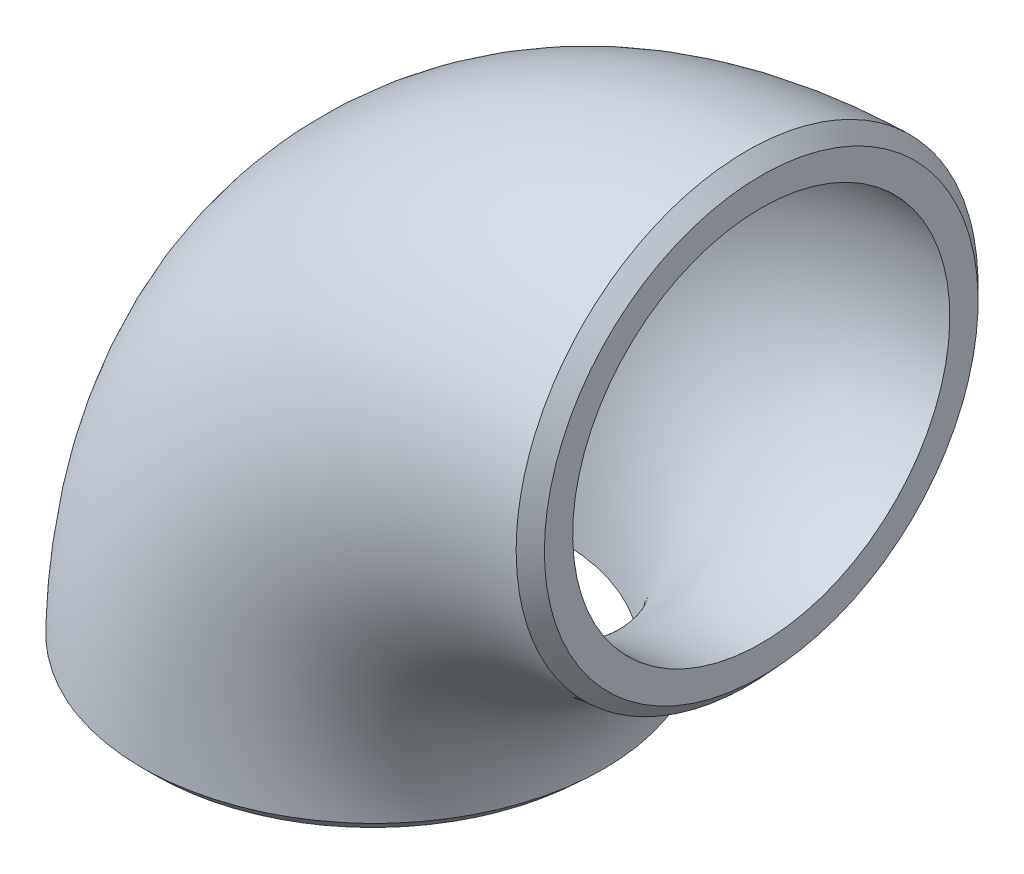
ISO-10303-21;
HEADER;
FILE_DESCRIPTION(('STEP AP214'),'2;1');
FILE_NAME('part.step','',(''),(''),'','','');
FILE_SCHEMA(('AUTOMOTIVE_DESIGN { 1 0 10303 214 1 1 1 1 }'));
ENDSEC;
DATA;
#1=APPLICATION_CONTEXT('core data for automotive mechanical design processes');
#2=APPLICATION_PROTOCOL_DEFINITION('international standard','automotive_design',2000,#1);
#3=PRODUCT_CONTEXT('',#1,'mechanical');
#4=PRODUCT('Part','Part','',(#3));
#5=PRODUCT_RELATED_PRODUCT_CATEGORY('part','',(#4));
#6=PRODUCT_DEFINITION_FORMATION('','',#4);
#7=PRODUCT_DEFINITION_CONTEXT('part definition',#1,'design');
#8=PRODUCT_DEFINITION('design','',#6,#7);
#9=PRODUCT_DEFINITION_SHAPE('','',#8);
#10=(LENGTH_UNIT() NAMED_UNIT(*) SI_UNIT(.MILLI.,.METRE.));
#11=(NAMED_UNIT(*) PLANE_ANGLE_UNIT() SI_UNIT($,.RADIAN.));
#12=(NAMED_UNIT(*) SI_UNIT($,.STERADIAN.) SOLID_ANGLE_UNIT());
#13=UNCERTAINTY_MEASURE_WITH_UNIT(LENGTH_MEASURE(1.E-05),#10,'distance_accuracy_value','');
#14=(GEOMETRIC_REPRESENTATION_CONTEXT(3) GLOBAL_UNCERTAINTY_ASSIGNED_CONTEXT((#13)) GLOBAL_UNIT_ASSIGNED_CONTEXT((#10,
#11,#12)) REPRESENTATION_CONTEXT('',''));
#15=CARTESIAN_POINT('',(0.,0.,0.));
#16=DIRECTION('',(0.,0.,1.));
#17=DIRECTION('',(1.,0.,0.));
#18=AXIS2_PLACEMENT_3D('',#15,#16,#17);
#19=CARTESIAN_POINT('',(0.,0.,0.));
#20=DIRECTION('',(0.,0.,1.));
#21=DIRECTION('',(1.,0.,0.));
#22=AXIS2_PLACEMENT_3D('',#19,#20,#21);
#23=TOROIDAL_SURFACE('',#22,50.8,30.1625);
#24=CARTESIAN_POINT('',(-50.8021834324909,1.84581266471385,30.1624788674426));
#25=CARTESIAN_POINT('',(-51.3117948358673,1.84694388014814,30.1620368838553));
#26=CARTESIAN_POINT('',(-51.8213640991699,1.84804264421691,30.1484199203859));
#27=CARTESIAN_POINT('',(-52.8417361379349,1.85018409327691,30.0952274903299));
#28=CARTESIAN_POINT('',(-53.3525321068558,1.85122646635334,30.0555210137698));
#29=CARTESIAN_POINT('',(-54.3714741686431,1.85325254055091,29.9505573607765));
#30=CARTESIAN_POINT('',(-54.879620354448,1.85423624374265,29.8853010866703));
#31=CARTESIAN_POINT('',(-55.8893374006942,1.85614135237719,29.7291455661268));
#32=CARTESIAN_POINT('',(-56.390928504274,1.85706304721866,29.6383774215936));
#33=CARTESIAN_POINT('',(-57.3865275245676,1.85884856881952,29.4320563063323));
#34=CARTESIAN_POINT('',(-57.8805599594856,1.85971264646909,29.3166214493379));
#35=CARTESIAN_POINT('',(-58.8620090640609,1.8613897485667,29.0612072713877));
#36=CARTESIAN_POINT('',(-59.3494285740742,1.86220279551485,28.9212388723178));
#37=CARTESIAN_POINT('',(-60.3177813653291,1.86378181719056,28.6163942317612));
#38=CARTESIAN_POINT('',(-60.7986949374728,1.86454766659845,28.4514553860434));
#39=CARTESIAN_POINT('',(-61.7541744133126,1.86603676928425,28.0966745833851));
#40=CARTESIAN_POINT('',(-62.228692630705,1.86675977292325,27.9067041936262));
#41=CARTESIAN_POINT('',(-63.1684070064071,1.86816210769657,27.5023429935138));
#42=CARTESIAN_POINT('',(-63.6335811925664,1.86884134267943,27.2879011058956));
#43=CARTESIAN_POINT('',(-64.5518152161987,1.8701555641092,26.8359840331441));
#44=CARTESIAN_POINT('',(-65.0048905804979,1.87079060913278,26.5985403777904));
#45=CARTESIAN_POINT('',(-65.8969787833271,1.87201740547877,26.1018987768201));
#46=CARTESIAN_POINT('',(-66.3360335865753,1.87260929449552,25.8427762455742));
#47=CARTESIAN_POINT('',(-67.1982440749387,1.87375082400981,25.3037096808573));
#48=CARTESIAN_POINT('',(-67.6214658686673,1.87430065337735,25.0238713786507));
#49=CARTESIAN_POINT('',(-68.4534762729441,1.87536352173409,24.4432348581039));
#50=CARTESIAN_POINT('',(-68.8622601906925,1.87587654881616,24.1424299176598));
#51=CARTESIAN_POINT('',(-69.665405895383,1.87686833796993,23.5196367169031));
#52=CARTESIAN_POINT('',(-70.0597188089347,1.87734698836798,23.1975854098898));
#53=CARTESIAN_POINT('',(-70.8332758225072,1.87827170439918,22.5323895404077));
#54=CARTESIAN_POINT('',(-71.2124427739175,1.87871761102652,22.1891552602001));
#55=CARTESIAN_POINT('',(-71.9543922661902,1.87957779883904,21.4823904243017));
#56=CARTESIAN_POINT('',(-72.3170997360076,1.8799919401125,21.1187810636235));
#57=CARTESIAN_POINT('',(-73.0216164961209,1.88078576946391,20.3755454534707));
#58=CARTESIAN_POINT('',(-73.3635274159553,1.88116563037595,19.9960155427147));
#59=CARTESIAN_POINT('',(-74.0259218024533,1.88189225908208,19.2219302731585));
#60=CARTESIAN_POINT('',(-74.3465025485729,1.88223918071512,18.827458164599));
#61=CARTESIAN_POINT('',(-74.9665235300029,1.88290236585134,18.0238810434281));
#62=CARTESIAN_POINT('',(-75.266016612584,1.88321870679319,17.614816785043));
#63=CARTESIAN_POINT('',(-75.8445127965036,1.88382357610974,16.7817985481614));
#64=CARTESIAN_POINT('',(-76.1234938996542,1.88411207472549,16.3578292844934));
#65=CARTESIAN_POINT('',(-76.6610026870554,1.88466256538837,15.4935660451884));
#66=CARTESIAN_POINT('',(-76.9193968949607,1.88492438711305,15.0531890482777));
#67=CARTESIAN_POINT('',(-77.4144844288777,1.88542162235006,14.1586294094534));
#68=CARTESIAN_POINT('',(-77.6511081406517,1.88565695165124,13.7044082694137));
#69=CARTESIAN_POINT('',(-78.1009160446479,1.88610074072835,12.7847426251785));
#70=CARTESIAN_POINT('',(-78.3141105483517,1.8863092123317,12.3193031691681));
#71=CARTESIAN_POINT('',(-78.7154890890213,1.88669909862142,11.3799190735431));
#72=CARTESIAN_POINT('',(-78.9037676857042,1.88688061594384,10.9060148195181));
#73=CARTESIAN_POINT('',(-79.2555432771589,1.88721780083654,9.95131401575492));
#74=CARTESIAN_POINT('',(-79.4191391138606,1.88737357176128,9.47055387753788));
#75=CARTESIAN_POINT('',(-79.7215286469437,1.88765996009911,8.50191953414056));
#76=CARTESIAN_POINT('',(-79.8603515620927,1.8877906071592,8.01405445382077));
#77=CARTESIAN_POINT('',(-80.1135609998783,1.88802786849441,7.03107988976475));
#78=CARTESIAN_POINT('',(-80.2279025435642,1.888134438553,6.53595882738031));
#79=CARTESIAN_POINT('',(-80.4319196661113,1.88832411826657,5.53815156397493));
#80=CARTESIAN_POINT('',(-80.5214729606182,1.88840711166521,5.03544032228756));
#81=CARTESIAN_POINT('',(-80.6749854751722,1.88854906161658,4.02430697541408));
#82=CARTESIAN_POINT('',(-80.738852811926,1.88860793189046,3.51587094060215));
#83=CARTESIAN_POINT('',(-80.840927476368,1.88870181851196,2.49691745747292));
#84=CARTESIAN_POINT('',(-80.8791590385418,1.88873685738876,1.98640243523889));
#85=CARTESIAN_POINT('',(-80.9292920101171,1.88878271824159,0.966873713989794));
#86=CARTESIAN_POINT('',(-80.9413363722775,1.88879367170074,0.45786708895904));
#87=CARTESIAN_POINT('',(-80.939511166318,1.88879199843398,-0.557723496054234));
#88=CARTESIAN_POINT('',(-80.9257618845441,1.88877948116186,-1.06430771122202));
#89=CARTESIAN_POINT('',(-80.872989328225,1.88873119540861,-2.07665028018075));
#90=CARTESIAN_POINT('',(-80.8339416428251,1.88869540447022,-2.58240736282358));
#91=CARTESIAN_POINT('',(-80.7300457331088,1.88859982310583,-3.59316652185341));
#92=CARTESIAN_POINT('',(-80.6651022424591,1.88853994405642,-4.09815882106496));
#93=CARTESIAN_POINT('',(-80.5092399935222,1.88839578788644,-5.10743010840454));
#94=CARTESIAN_POINT('',(-80.4181574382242,1.88831135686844,-5.61168378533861));
#95=CARTESIAN_POINT('',(-80.2103981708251,1.88811812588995,-6.61511009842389));
#96=CARTESIAN_POINT('',(-80.0937108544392,1.88800931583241,-7.11428053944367));
#97=CARTESIAN_POINT('',(-79.83554258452,1.88776726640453,-8.10403625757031));
#98=CARTESIAN_POINT('',(-79.6941626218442,1.88763412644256,-8.5946478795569));
#99=CARTESIAN_POINT('',(-79.3872584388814,1.88734327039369,-9.5663296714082));
#100=CARTESIAN_POINT('',(-79.2218223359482,1.88718564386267,-10.0474276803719));
#101=CARTESIAN_POINT('',(-78.8674177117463,1.88684563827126,-10.9992481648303));
#102=CARTESIAN_POINT('',(-78.6785206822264,1.8866633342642,-11.4699972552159));
#103=CARTESIAN_POINT('',(-78.27668021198,1.88627263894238,-12.4023688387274));
#104=CARTESIAN_POINT('',(-78.0636838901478,1.88606419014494,-12.8639685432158));
#105=CARTESIAN_POINT('',(-77.6138284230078,1.88561998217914,-13.7775381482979));
#106=CARTESIAN_POINT('',(-77.3768828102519,1.88538412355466,-14.2294654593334));
#107=CARTESIAN_POINT('',(-76.8796742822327,1.88488425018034,-15.1221363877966));
#108=CARTESIAN_POINT('',(-76.6193417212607,1.88462015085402,-15.5628412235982));
#109=CARTESIAN_POINT('',(-76.0760340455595,1.88406312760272,-16.4311425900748));
#110=CARTESIAN_POINT('',(-75.793019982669,1.88377015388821,-16.8587147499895));
#111=CARTESIAN_POINT('',(-75.207192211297,1.88315673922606,-17.6967137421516));
#112=CARTESIAN_POINT('',(-74.9044909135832,1.88283645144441,-18.1072191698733));
#113=CARTESIAN_POINT('',(-74.2800239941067,1.88216726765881,-18.9104482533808));
#114=CARTESIAN_POINT('',(-73.9583522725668,1.8818185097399,-19.3032448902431));
#115=CARTESIAN_POINT('',(-73.2961159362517,1.8810907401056,-20.0714197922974));
#116=CARTESIAN_POINT('',(-72.9555837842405,1.88071177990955,-20.4468260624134));
#117=CARTESIAN_POINT('',(-72.2555865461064,1.87992185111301,-21.1809871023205));
#118=CARTESIAN_POINT('',(-71.8960852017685,1.8795108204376,-21.5397073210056));
#119=CARTESIAN_POINT('',(-71.156647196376,1.87865228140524,-22.2405024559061));
#120=CARTESIAN_POINT('',(-70.7765904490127,1.8782045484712,-22.5824506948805));
#121=CARTESIAN_POINT('',(-69.9987131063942,1.87727315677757,-23.2477234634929));
#122=CARTESIAN_POINT('',(-69.6008464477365,1.87678940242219,-23.5709940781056));
#123=CARTESIAN_POINT('',(-68.7901882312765,1.87578661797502,-24.1963253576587));
#124=CARTESIAN_POINT('',(-68.3774321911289,1.87526766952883,-24.4984320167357));
#125=CARTESIAN_POINT('',(-67.5393321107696,1.8741945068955,-25.0791612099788));
#126=CARTESIAN_POINT('',(-67.1140769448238,1.87364051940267,-25.3579120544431));
#127=CARTESIAN_POINT('',(-66.2513235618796,1.87249545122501,-25.8931747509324));
#128=CARTESIAN_POINT('',(-65.8138598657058,1.87190447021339,-26.1497422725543));
#129=CARTESIAN_POINT('',(-64.9262172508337,1.87068103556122,-26.6405728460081));
#130=CARTESIAN_POINT('',(-64.4760303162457,1.87004855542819,-26.8748214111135));
#131=CARTESIAN_POINT('',(-63.562749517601,1.86873843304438,-27.3211117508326));
#132=CARTESIAN_POINT('',(-63.0996145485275,1.86806063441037,-27.5330693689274));
#133=CARTESIAN_POINT('',(-62.1609835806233,1.86665712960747,-27.9343215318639));
#134=CARTESIAN_POINT('',(-61.6854387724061,1.86593120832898,-28.1235019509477));
#135=CARTESIAN_POINT('',(-60.7250068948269,1.86443111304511,-28.4773761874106));
#136=CARTESIAN_POINT('',(-60.2401144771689,1.86365691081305,-28.6420554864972));
#137=CARTESIAN_POINT('',(-59.2636337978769,1.86206062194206,-28.9464256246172));
#138=CARTESIAN_POINT('',(-58.7720611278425,1.86123863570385,-29.086166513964));
#139=CARTESIAN_POINT('',(-57.7847052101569,1.85954658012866,-29.3399414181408));
#140=CARTESIAN_POINT('',(-57.2889513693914,1.85867674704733,-29.4540897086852));
#141=CARTESIAN_POINT('',(-56.2938845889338,1.85688569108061,-29.6565624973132));
#142=CARTESIAN_POINT('',(-55.7945885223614,1.85596464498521,-29.7449699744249));
#143=CARTESIAN_POINT('',(-54.7910091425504,1.8540645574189,-29.8968319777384));
#144=CARTESIAN_POINT('',(-54.2867168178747,1.85308538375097,-29.9602269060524));
#145=CARTESIAN_POINT('',(-53.2738701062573,1.85106505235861,-30.0617121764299));
#146=CARTESIAN_POINT('',(-52.7653070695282,1.85002369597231,-30.0997161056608));
#147=CARTESIAN_POINT('',(-51.7447028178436,1.84787645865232,-30.150417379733));
#148=CARTESIAN_POINT('',(-51.2326560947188,1.84677031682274,-30.163003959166));
#149=CARTESIAN_POINT('',(-50.2074032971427,1.8444898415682,-30.1619252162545));
#150=CARTESIAN_POINT('',(-49.6941972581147,1.84331535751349,-30.1481995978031));
#151=CARTESIAN_POINT('',(-48.6694694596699,1.84089696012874,-30.0941197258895));
#152=CARTESIAN_POINT('',(-48.1579469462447,1.83965308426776,-30.0537797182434));
#153=CARTESIAN_POINT('',(-47.1380624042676,1.83709649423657,-29.9471442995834));
#154=CARTESIAN_POINT('',(-46.6296980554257,1.8357838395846,-29.8808710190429));
#155=CARTESIAN_POINT('',(-45.617612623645,1.83308907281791,-29.7227934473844));
#156=CARTESIAN_POINT('',(-45.1138864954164,1.83170705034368,-29.6310214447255));
#157=CARTESIAN_POINT('',(-44.1125594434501,1.82887323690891,-29.4224362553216));
#158=CARTESIAN_POINT('',(-43.6149494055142,1.82742157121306,-29.3056668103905));
#159=CARTESIAN_POINT('',(-42.6273409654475,1.82444809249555,-29.0475510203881));
#160=CARTESIAN_POINT('',(-42.1373279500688,1.82292644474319,-28.9062605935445));
#161=CARTESIAN_POINT('',(-41.1663915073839,1.81981255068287,-28.599595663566));
#162=CARTESIAN_POINT('',(-40.6854465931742,1.81822051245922,-28.4342892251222));
#163=CARTESIAN_POINT('',(-39.7340128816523,1.81496520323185,-28.0799368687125));
#164=CARTESIAN_POINT('',(-39.2634971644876,1.81330215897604,-27.8909632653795));
#165=CARTESIAN_POINT('',(-38.3312427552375,1.80989180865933,-27.4887086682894));
#166=CARTESIAN_POINT('',(-37.8695358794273,1.8081442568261,-27.2753539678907));
#167=CARTESIAN_POINT('',(-36.9554984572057,1.80456605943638,-26.8247657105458));
#168=CARTESIAN_POINT('',(-36.5032159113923,1.80273509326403,-26.5874348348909));
#169=CARTESIAN_POINT('',(-35.6100935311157,1.79899568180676,-26.0896810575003));
#170=CARTESIAN_POINT('',(-35.1692841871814,1.7970870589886,-25.8292034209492));
#171=CARTESIAN_POINT('',(-34.3014765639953,1.79319866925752,-25.2859882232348));
#172=CARTESIAN_POINT('',(-33.8744811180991,1.79121888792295,-25.0032461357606));
#173=CARTESIAN_POINT('',(-33.0375402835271,1.78720254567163,-24.4180533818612));
#174=CARTESIAN_POINT('',(-32.6275174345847,1.78516633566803,-24.1157134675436));
#175=CARTESIAN_POINT('',(-31.8249127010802,1.78104415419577,-23.4918608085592));
#176=CARTESIAN_POINT('',(-31.4322684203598,1.77895841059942,-23.170428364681));
#177=CARTESIAN_POINT('',(-30.6640780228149,1.77474057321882,-22.5084807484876));
#178=CARTESIAN_POINT('',(-30.288515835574,1.77260852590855,-22.1679842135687));
#179=CARTESIAN_POINT('',(-29.5538001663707,1.76829929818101,-21.4678471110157));
#180=CARTESIAN_POINT('',(-29.1946920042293,1.76612201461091,-21.1081589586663));
#181=CARTESIAN_POINT('',(-28.4932259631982,1.76172549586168,-20.3684647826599));
#182=CARTESIAN_POINT('',(-28.1509884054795,1.75950608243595,-19.9883446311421));
#183=CARTESIAN_POINT('',(-27.4853082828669,1.75505417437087,-19.2105582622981));
#184=CARTESIAN_POINT('',(-27.1619086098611,1.75282166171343,-18.8128553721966));
#185=CARTESIAN_POINT('',(-26.5364959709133,1.74837314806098,-18.0027929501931));
#186=CARTESIAN_POINT('',(-26.2344238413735,1.74615711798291,-17.5904791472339));
#187=CARTESIAN_POINT('',(-25.653853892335,1.74176734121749,-16.7534483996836));
#188=CARTESIAN_POINT('',(-25.3752187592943,1.73959341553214,-16.3288266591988));
#189=CARTESIAN_POINT('',(-24.8399039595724,1.73530209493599,-15.467064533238));
#190=CARTESIAN_POINT('',(-24.5831843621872,1.73318460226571,-15.0299489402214));
#191=CARTESIAN_POINT('',(-24.0918200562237,1.72902736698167,-14.1426213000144));
#192=CARTESIAN_POINT('',(-23.8572087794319,1.72698774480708,-13.6923907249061));
#193=CARTESIAN_POINT('',(-23.4100545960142,1.72300678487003,-12.7785848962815));
#194=CARTESIAN_POINT('',(-23.1976160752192,1.72106593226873,-12.3149585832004));
#195=CARTESIAN_POINT('',(-22.7954898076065,1.71731006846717,-11.3753161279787));
#196=CARTESIAN_POINT('',(-22.6059156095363,1.71549570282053,-10.899251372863));
#197=CARTESIAN_POINT('',(-22.2515986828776,1.71204001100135,-9.93858050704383));
#198=CARTESIAN_POINT('',(-22.0868281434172,1.71039849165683,-9.45398465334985));
#199=CARTESIAN_POINT('',(-21.7824662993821,1.7073143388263,-8.47839706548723));
#200=CARTESIAN_POINT('',(-21.642807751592,1.70587117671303,-7.98742630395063));
#201=CARTESIAN_POINT('',(-21.389147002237,1.70321142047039,-7.00104481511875));
#202=CARTESIAN_POINT('',(-21.2750418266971,1.70199392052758,-6.50566059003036));
#203=CARTESIAN_POINT('',(-21.0724239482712,1.69981060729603,-5.51086482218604));
#204=CARTESIAN_POINT('',(-20.9838534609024,1.69884422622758,-5.01146504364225));
#205=CARTESIAN_POINT('',(-20.8317082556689,1.69717255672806,-4.00744241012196));
#206=CARTESIAN_POINT('',(-20.7682042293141,1.6964680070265,-3.50280884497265));
#207=CARTESIAN_POINT('',(-20.6666661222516,1.69533355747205,-2.48906086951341));
#208=CARTESIAN_POINT('',(-20.6287289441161,1.69490470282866,-1.97993673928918));
#209=CARTESIAN_POINT('',(-20.5787228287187,1.69433629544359,-0.958000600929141));
#210=CARTESIAN_POINT('',(-20.5667773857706,1.69419812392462,-0.445182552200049));
#211=CARTESIAN_POINT('',(-20.5690538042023,1.69422383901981,0.579722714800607));
#212=CARTESIAN_POINT('',(-20.583241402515,1.69438733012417,1.09181001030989));
#213=CARTESIAN_POINT('',(-20.6376054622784,1.69500439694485,2.11139864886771));
#214=CARTESIAN_POINT('',(-20.6776190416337,1.69545615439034,2.61890865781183));
#215=CARTESIAN_POINT('',(-20.7832774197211,1.69663522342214,3.6293881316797));
#216=CARTESIAN_POINT('',(-20.8488288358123,1.69736153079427,4.13236738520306));
#217=CARTESIAN_POINT('',(-21.0048672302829,1.6990737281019,5.13393517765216));
#218=CARTESIAN_POINT('',(-21.0953295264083,1.700059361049,5.63252756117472));
#219=CARTESIAN_POINT('',(-21.3020918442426,1.70228297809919,6.62699179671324));
#220=CARTESIAN_POINT('',(-21.4185215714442,1.70352222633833,7.12283671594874));
#221=CARTESIAN_POINT('',(-21.6770344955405,1.70622552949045,8.11041312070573));
#222=CARTESIAN_POINT('',(-21.8192421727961,1.70769066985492,8.60211196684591));
#223=CARTESIAN_POINT('',(-22.1283428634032,1.71081340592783,9.57814666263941));
#224=CARTESIAN_POINT('',(-22.2952564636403,1.71247116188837,10.0624759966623));
#225=CARTESIAN_POINT('',(-22.6532452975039,1.71595050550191,11.0203597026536));
#226=CARTESIAN_POINT('',(-22.8442416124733,1.71777155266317,11.493943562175));
#227=CARTESIAN_POINT('',(-23.2489896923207,1.72153760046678,12.4286412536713));
#228=CARTESIAN_POINT('',(-23.4626305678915,1.72348197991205,12.8898031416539));
#229=CARTESIAN_POINT('',(-23.9124456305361,1.72747123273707,13.7998037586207));
#230=CARTESIAN_POINT('',(-24.1485715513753,1.72951588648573,14.2486663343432));
#231=CARTESIAN_POINT('',(-24.6434657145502,1.73368568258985,15.1342514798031));
#232=CARTESIAN_POINT('',(-24.9022540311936,1.73581089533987,15.5709628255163));
#233=CARTESIAN_POINT('',(-25.4423484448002,1.74012060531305,16.4325867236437));
#234=CARTESIAN_POINT('',(-25.7237375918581,1.74230529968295,16.8574472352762));
#235=CARTESIAN_POINT('',(-26.3092433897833,1.74671049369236,17.6940103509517));
#236=CARTESIAN_POINT('',(-26.6134548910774,1.7489311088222,18.1056465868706));
#237=CARTESIAN_POINT('',(-27.2424865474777,1.75338241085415,18.9133351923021));
#238=CARTESIAN_POINT('',(-27.5673218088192,1.75561310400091,19.3093757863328));
#239=CARTESIAN_POINT('',(-28.2354098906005,1.76005730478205,20.0832839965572));
#240=CARTESIAN_POINT('',(-28.5785966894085,1.76227084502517,20.4612085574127));
#241=CARTESIAN_POINT('',(-29.281755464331,1.7666543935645,21.196530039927));
#242=CARTESIAN_POINT('',(-29.6416073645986,1.76882458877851,21.5540418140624));
#243=CARTESIAN_POINT('',(-30.3783034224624,1.77312265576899,22.2504301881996));
#244=CARTESIAN_POINT('',(-30.7551323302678,1.77525056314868,22.5893229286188));
#245=CARTESIAN_POINT('',(-31.5263891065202,1.77946281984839,23.248551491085));
#246=CARTESIAN_POINT('',(-31.9208600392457,1.78154704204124,23.5688369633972));
#247=CARTESIAN_POINT('',(-32.7276115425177,1.78566798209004,24.1906501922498));
#248=CARTESIAN_POINT('',(-33.1399744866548,1.78770439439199,24.4920710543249));
#249=CARTESIAN_POINT('',(-33.9815091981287,1.79171966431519,25.0751415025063));
#250=CARTESIAN_POINT('',(-34.4107547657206,1.79369818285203,25.3566845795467));
#251=CARTESIAN_POINT('',(-35.2813296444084,1.79757591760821,25.8964586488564));
#252=CARTESIAN_POINT('',(-35.7226048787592,1.79947541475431,26.1547768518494));
#253=CARTESIAN_POINT('',(-36.6158945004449,1.80319338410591,26.6476900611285));
#254=CARTESIAN_POINT('',(-37.0678585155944,1.8050121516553,26.8823763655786));
#255=CARTESIAN_POINT('',(-37.9815847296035,1.80856891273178,27.3279500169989));
#256=CARTESIAN_POINT('',(-38.4433110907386,1.81030714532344,27.5389108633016));
#257=CARTESIAN_POINT('',(-39.3765959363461,1.81370609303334,27.9372535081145));
#258=CARTESIAN_POINT('',(-39.8481501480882,1.81536684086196,28.1246453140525));
#259=CARTESIAN_POINT('',(-40.8021428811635,1.8186190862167,28.476068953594));
#260=CARTESIAN_POINT('',(-41.28461891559,1.82021026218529,28.6399989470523));
#261=CARTESIAN_POINT('',(-42.2588186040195,1.82332258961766,28.9438707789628));
#262=CARTESIAN_POINT('',(-42.7505675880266,1.82484349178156,29.083731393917));
#263=CARTESIAN_POINT('',(-43.7416284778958,1.82781350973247,29.3386053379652));
#264=CARTESIAN_POINT('',(-44.2409547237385,1.82926245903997,29.453562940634));
#265=CARTESIAN_POINT('',(-45.2438233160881,1.83208339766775,29.6576849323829));
#266=CARTESIAN_POINT('',(-45.7473553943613,1.83345553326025,29.7468997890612));
#267=CARTESIAN_POINT('',(-46.7554170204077,1.8361212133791,29.8992728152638));
#268=CARTESIAN_POINT('',(-47.2599245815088,1.83741516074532,29.9625763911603));
#269=CARTESIAN_POINT('',(-48.2700785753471,1.83993068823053,30.0633696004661));
#270=CARTESIAN_POINT('',(-48.775717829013,1.84115246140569,30.1009312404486));
#271=CARTESIAN_POINT('',(-49.7883071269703,1.84353077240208,30.1506918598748));
#272=CARTESIAN_POINT('',(-50.2952573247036,1.84468730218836,30.1628877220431));
#273=CARTESIAN_POINT('',(-50.8021834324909,1.84581266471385,30.1624788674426));
#274=B_SPLINE_CURVE_WITH_KNOTS('',3,(#24,#25,#26,#27,#28,#29,#30,#31,#32,#33,#34,#35,#36,#37,
#38,#39,#40,#41,#42,#43,#44,#45,#46,#47,#48,#49,#50,#51,#52,#53,#54,#55,#56,#57,#58,#59,#60,#61,
#62,#63,#64,#65,#66,#67,#68,#69,#70,#71,#72,#73,#74,#75,#76,#77,#78,#79,#80,#81,#82,#83,#84,#85,
#86,#87,#88,#89,#90,#91,#92,#93,#94,#95,#96,#97,#98,#99,#100,#101,#102,#103,#104,#105,#106,#107,
#108,#109,#110,#111,#112,#113,#114,#115,#116,#117,#118,#119,#120,#121,#122,#123,#124,#125,#126,
#127,#128,#129,#130,#131,#132,#133,#134,#135,#136,#137,#138,#139,#140,#141,#142,#143,#144,#145,
#146,#147,#148,#149,#150,#151,#152,#153,#154,#155,#156,#157,#158,#159,#160,#161,#162,#163,#164,
#165,#166,#167,#168,#169,#170,#171,#172,#173,#174,#175,#176,#177,#178,#179,#180,#181,#182,#183,
#184,#185,#186,#187,#188,#189,#190,#191,#192,#193,#194,#195,#196,#197,#198,#199,#200,#201,#202,
#203,#204,#205,#206,#207,#208,#209,#210,#211,#212,#213,#214,#215,#216,#217,#218,#219,#220,#221,
#222,#223,#224,#225,#226,#227,#228,#229,#230,#231,#232,#233,#234,#235,#236,#237,#238,#239,#240,
#241,#242,#243,#244,#245,#246,#247,#248,#249,#250,#251,#252,#253,#254,#255,#256,#257,#258,#259,
#260,#261,#262,#263,#264,#265,#266,#267,#268,#269,#270,#271,#272,#273),.UNSPECIFIED.,.F.,.F.,(4,
2,2,2,2,2,2,2,2,2,2,2,2,2,2,2,2,2,2,2,2,2,2,2,2,2,2,2,2,2,2,2,2,2,2,2,2,2,2,2,2,2,2,2,2,2,2,2,2,
2,2,2,2,2,2,2,2,2,2,2,2,2,2,2,2,2,2,2,2,2,2,2,2,2,2,2,2,2,2,2,2,2,2,2,2,2,2,2,2,2,2,2,2,2,2,2,2,
2,2,2,2,2,2,2,2,2,2,2,2,2,2,2,2,2,2,2,2,2,2,2,2,2,2,2,4),(0.,1.52862159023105,3.06497851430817,
4.60128118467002,6.12982899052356,7.65121527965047,9.17192598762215,10.6965144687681,
12.2292543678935,13.7652540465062,15.2991772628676,16.8279701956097,18.349436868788,
19.8713936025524,21.3980896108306,22.9317666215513,24.4718512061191,26.0036777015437,
27.5279563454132,29.0482680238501,30.5701870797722,32.1012831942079,33.6371163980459,
35.1722709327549,36.701421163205,38.2242753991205,39.745321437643,41.2691385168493,
42.8003440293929,44.336979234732,45.8721597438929,47.3989386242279,48.9186152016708,
50.4397603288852,51.966553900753,53.5031320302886,55.0403477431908,56.5714176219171,
58.0970142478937,59.6180710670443,61.1425327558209,62.6727096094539,64.2076047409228,
65.7451944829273,67.2746671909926,68.7971183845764,70.3170259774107,71.8399521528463,
73.3730144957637,74.9103012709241,76.4441362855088,77.9689008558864,79.4897206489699,
81.0115209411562,82.538874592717,84.0735879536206,85.6092071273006,87.1417088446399,
88.6672249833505,90.1877675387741,91.71191155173,93.2412165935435,94.7771718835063,
96.3166511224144,97.8553069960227,99.3926526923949,100.928060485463,102.460803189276,
103.99009544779,105.515135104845,107.035623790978,108.560837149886,110.092511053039,
111.627908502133,113.16361890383,114.691301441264,116.212960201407,117.733156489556,
119.257315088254,120.791114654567,122.328280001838,123.860998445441,125.383999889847,
126.904164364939,128.426591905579,129.95589097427,131.4924967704,133.027366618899,
134.558063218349,136.082475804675,137.603411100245,139.128605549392,140.659548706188,
142.197750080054,143.73393615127,145.260527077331,146.781587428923,148.301146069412,
149.828471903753,151.363379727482,152.899573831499,154.43085867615,155.954963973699,
157.475868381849,158.998133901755,160.526274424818,162.061161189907,163.59718547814,
165.128013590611,166.649146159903,168.168938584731,169.692668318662,171.224369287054,
172.763736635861,174.297058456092,175.824208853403,177.346489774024,178.868122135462,
180.396171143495,181.929279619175,183.465784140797,184.999255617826,186.523999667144,
188.044461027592,189.565109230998),.UNSPECIFIED.);
#275=CARTESIAN_POINT('',(-50.8021834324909,1.84581266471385,30.1624788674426));
#276=VERTEX_POINT('',#275);
#277=EDGE_CURVE('E51',#276,#276,#274,.F.);
#278=ORIENTED_EDGE('',*,*,#277,.T.);
#279=EDGE_LOOP('',(#278));
#280=FACE_BOUND('',#279,.T.);
#281=CARTESIAN_POINT('',(-1.84581266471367,50.8021834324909,30.1624788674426));
#282=CARTESIAN_POINT('',(-1.84145368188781,48.8367867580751,30.1657311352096));
#283=CARTESIAN_POINT('',(-1.83651625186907,46.8320554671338,29.9706749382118));
#284=CARTESIAN_POINT('',(-1.82571336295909,42.9680018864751,29.2038384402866));
#285=CARTESIAN_POINT('',(-1.81981806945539,41.0881747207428,28.637954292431));
#286=CARTESIAN_POINT('',(-1.80669403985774,37.423460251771,27.1284470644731));
#287=CARTESIAN_POINT('',(-1.79950140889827,35.6582775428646,26.1869671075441));
#288=CARTESIAN_POINT('',(-1.78429729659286,32.3916839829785,24.0108359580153));
#289=CARTESIAN_POINT('',(-1.77617168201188,30.8612771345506,22.7644580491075));
#290=CARTESIAN_POINT('',(-1.75911871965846,28.0366627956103,19.9518360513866));
#291=CARTESIAN_POINT('',(-1.75044538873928,26.7848516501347,18.4280128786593));
#292=CARTESIAN_POINT('',(-1.73359867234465,24.594799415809,15.1704889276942));
#293=CARTESIAN_POINT('',(-1.72530548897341,23.6449340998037,13.4064570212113));
#294=CARTESIAN_POINT('',(-1.71095772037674,22.1230048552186,9.75070488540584));
#295=CARTESIAN_POINT('',(-1.70496262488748,21.549981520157,7.87319779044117));
#296=CARTESIAN_POINT('',(-1.69654432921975,20.7699337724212,4.00702180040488));
#297=CARTESIAN_POINT('',(-1.69422938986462,20.569524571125,2.00386437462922));
#298=CARTESIAN_POINT('',(-1.69419145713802,20.5662080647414,-1.92486286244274));
#299=CARTESIAN_POINT('',(-1.69635426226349,20.7530889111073,-3.88164146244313));
#300=CARTESIAN_POINT('',(-1.70469636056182,21.5245520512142,-7.78665267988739));
#301=CARTESIAN_POINT('',(-1.71074374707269,22.1018630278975,-9.68646134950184));
#302=CARTESIAN_POINT('',(-1.72490681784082,23.6011255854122,-13.3141751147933));
#303=CARTESIAN_POINT('',(-1.73309902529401,24.5343192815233,-15.0683199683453));
#304=CARTESIAN_POINT('',(-1.75015660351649,26.7430536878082,-18.3774320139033));
#305=CARTESIAN_POINT('',(-1.75879983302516,27.9908546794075,-19.8954193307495));
#306=CARTESIAN_POINT('',(-1.77562571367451,30.7641504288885,-22.6780700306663));
#307=CARTESIAN_POINT('',(-1.78393552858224,32.3184631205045,-23.957243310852));
#308=CARTESIAN_POINT('',(-1.79922750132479,35.5951297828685,-26.1495093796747));
#309=CARTESIAN_POINT('',(-1.80630226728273,37.3243779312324,-27.0784352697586));
#310=CARTESIAN_POINT('',(-1.81946304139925,40.9793087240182,-28.6018074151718));
#311=CARTESIAN_POINT('',(-1.82549847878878,42.8958284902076,-29.1856212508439));
#312=CARTESIAN_POINT('',(-1.83628391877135,46.7444575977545,-29.9570325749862));
#313=CARTESIAN_POINT('',(-1.84115396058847,48.7113017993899,-30.1565296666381));
#314=CARTESIAN_POINT('',(-1.8544419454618,54.67444779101,-30.1742147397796));
#315=CARTESIAN_POINT('',(-1.86135566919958,58.6554551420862,-29.3761854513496));
#316=CARTESIAN_POINT('',(-1.86957740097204,64.0967165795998,-27.131379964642));
#317=CARTESIAN_POINT('',(-1.872010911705,65.8574201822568,-26.1955737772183));
#318=CARTESIAN_POINT('',(-1.87629608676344,69.16291974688,-23.9911460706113));
#319=CARTESIAN_POINT('',(-1.87811827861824,70.6810993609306,-22.7450506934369));
#320=CARTESIAN_POINT('',(-1.8813084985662,73.4680045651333,-19.9691846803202));
#321=CARTESIAN_POINT('',(-1.88268470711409,74.748293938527,-18.413238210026));
#322=CARTESIAN_POINT('',(-1.88495635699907,76.9369282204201,-15.1410099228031));
#323=CARTESIAN_POINT('',(-1.88587615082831,77.8664571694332,-13.4113757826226));
#324=CARTESIAN_POINT('',(-1.88735318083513,79.3910110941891,-9.74702647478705));
#325=CARTESIAN_POINT('',(-1.88789585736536,79.9711117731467,-7.83611901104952));
#326=CARTESIAN_POINT('',(-1.88861010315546,80.7397126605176,-3.98628049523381));
#327=CARTESIAN_POINT('',(-1.88879130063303,80.9387489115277,-2.01903124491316));
#328=CARTESIAN_POINT('',(-1.88879442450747,80.9421586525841,1.96710579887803));
#329=CARTESIAN_POINT('',(-1.88861697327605,80.7472338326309,3.92711957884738));
#330=CARTESIAN_POINT('',(-1.88791052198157,79.9867679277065,7.77874099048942));
#331=CARTESIAN_POINT('',(-1.88736807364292,79.4067558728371,9.70013024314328));
#332=CARTESIAN_POINT('',(-1.88590283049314,77.8936348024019,13.3547873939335));
#333=CARTESIAN_POINT('',(-1.88498881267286,76.9690591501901,15.0864243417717));
#334=CARTESIAN_POINT('',(-1.8827188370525,74.7803279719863,18.3717859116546));
#335=CARTESIAN_POINT('',(-1.88134878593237,73.5047463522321,19.927019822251));
#336=CARTESIAN_POINT('',(-1.87817313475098,70.727540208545,22.7041229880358));
#337=CARTESIAN_POINT('',(-1.87635485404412,69.210284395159,23.9553949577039));
#338=CARTESIAN_POINT('',(-1.87206948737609,65.900618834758,26.1708260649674));
#339=CARTESIAN_POINT('',(-1.86965516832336,64.1511449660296,27.1041375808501));
#340=CARTESIAN_POINT('',(-1.86418555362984,60.5254354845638,28.6093621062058));
#341=CARTESIAN_POINT('',(-1.86108902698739,58.6220867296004,29.1905548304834));
#342=CARTESIAN_POINT('',(-1.85404413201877,54.7227749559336,29.9679638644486));
#343=CARTESIAN_POINT('',(-1.85017164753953,52.7675801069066,30.1592265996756));
#344=CARTESIAN_POINT('',(-1.84581266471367,50.8021834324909,30.1624788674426));
#345=B_SPLINE_CURVE_WITH_KNOTS('',3,(#281,#282,#283,#284,#285,#286,#287,#288,#289,#290,#291,
#292,#293,#294,#295,#296,#297,#298,#299,#300,#301,#302,#303,#304,#305,#306,#307,#308,#309,#310,
#311,#312,#313,#314,#315,#316,#317,#318,#319,#320,#321,#322,#323,#324,#325,#326,#327,#328,#329,
#330,#331,#332,#333,#334,#335,#336,#337,#338,#339,#340,#341,#342,#343,#344),.UNSPECIFIED.,.T.,
.F.,(4,2,2,2,2,2,2,2,2,2,2,2,2,2,2,2,2,2,2,2,2,2,2,2,2,2,2,2,2,2,2,4),(-0.174083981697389,
-0.1685491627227,-0.163014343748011,-0.157479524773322,-0.151944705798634,-0.146409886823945,
-0.140875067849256,-0.135340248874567,-0.129805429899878,-0.124270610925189,-0.118735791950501,
-0.113200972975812,-0.107666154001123,-0.102131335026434,-0.0965965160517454,
-0.0910616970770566,-0.0855268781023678,-0.0744572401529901,-0.0689224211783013,
-0.0633876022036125,-0.0578527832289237,-0.0523179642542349,-0.0467831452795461,
-0.0412483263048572,-0.0357135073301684,-0.0301786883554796,-0.0246438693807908,
-0.019109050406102,-0.0135742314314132,-0.00803941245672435,-0.00250459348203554,
0.00303022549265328),.UNSPECIFIED.);
#346=CARTESIAN_POINT('',(-1.84581266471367,50.8021834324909,30.1624788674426));
#347=VERTEX_POINT('',#346);
#348=EDGE_CURVE('E56',#347,#347,#345,.F.);
#349=ORIENTED_EDGE('',*,*,#348,.T.);
#350=EDGE_LOOP('',(#349));
#351=FACE_BOUND('',#350,.T.);
#352=ADVANCED_FACE('F34',(#280,#351),#23,.T.);
#353=CARTESIAN_POINT('',(1.6608738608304E-13,50.8,0.));
#354=DIRECTION('',(1.,0.,0.));
#355=DIRECTION('',(0.,0.,1.));
#356=AXIS2_PLACEMENT_3D('',#353,#354,#355);
#357=PLANE('',#356);
#358=CARTESIAN_POINT('',(1.84887373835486E-13,50.8,28.3167468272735));
#359=CARTESIAN_POINT('',(1.86440598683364E-13,51.2757941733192,28.3160035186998));
#360=CARTESIAN_POINT('',(1.88002315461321E-13,51.7515831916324,28.3034359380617));
#361=CARTESIAN_POINT('',(1.91130697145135E-13,52.7020334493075,28.2544918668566));
#362=CARTESIAN_POINT('',(1.92697363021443E-13,53.1766944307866,28.2181103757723));
#363=CARTESIAN_POINT('',(1.95827807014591E-13,54.1250433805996,28.1212278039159));
#364=CARTESIAN_POINT('',(1.97391560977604E-13,54.5987237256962,28.0606520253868));
#365=CARTESIAN_POINT('',(2.0050000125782E-13,55.5452445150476,27.9152495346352));
#366=CARTESIAN_POINT('',(2.02044517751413E-13,56.0180630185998,27.8302800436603));
#367=CARTESIAN_POINT('',(2.05121969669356E-13,56.9595101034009,27.6362428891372));
#368=CARTESIAN_POINT('',(2.06654882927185E-13,57.4281308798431,27.5271373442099));
#369=CARTESIAN_POINT('',(2.09704571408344E-13,58.3579490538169,27.2855367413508));
#370=CARTESIAN_POINT('',(2.11221379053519E-13,58.8191630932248,27.1531057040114));
#371=CARTESIAN_POINT('',(2.14225535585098E-13,59.7327533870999,26.865572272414));
#372=CARTESIAN_POINT('',(2.15712966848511E-13,60.1851542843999,26.7105481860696));
#373=CARTESIAN_POINT('',(2.18645832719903E-13,61.079764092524,26.378382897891));
#374=CARTESIAN_POINT('',(2.20091408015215E-13,61.5220057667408,26.2013299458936));
#375=CARTESIAN_POINT('',(2.2295016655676E-13,62.3973901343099,25.8249868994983));
#376=CARTESIAN_POINT('',(2.24363319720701E-13,62.8305243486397,25.6256770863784));
#377=CARTESIAN_POINT('',(2.27166195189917E-13,63.6876442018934,25.2047913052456));
#378=CARTESIAN_POINT('',(2.2855582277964E-13,64.111594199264,24.9831427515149));
#379=CARTESIAN_POINT('',(2.31311643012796E-13,64.9493426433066,24.5177797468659));
#380=CARTESIAN_POINT('',(2.32677724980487E-13,65.3630957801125,24.2739837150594));
#381=CARTESIAN_POINT('',(2.35394353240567E-13,66.1790567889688,23.7647672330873));
#382=CARTESIAN_POINT('',(2.36744829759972E-13,66.5812199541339,23.4992751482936));
#383=CARTESIAN_POINT('',(2.39383052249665E-13,67.3694974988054,22.9495909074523));
#384=CARTESIAN_POINT('',(2.40671084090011E-13,67.7556835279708,22.6655014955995));
#385=CARTESIAN_POINT('',(2.43180236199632E-13,68.5111422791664,22.0795139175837));
#386=CARTESIAN_POINT('',(2.44401665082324E-13,68.8804914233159,21.7777142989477));
#387=CARTESIAN_POINT('',(2.46779244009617E-13,69.6025832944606,21.1565617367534));
#388=CARTESIAN_POINT('',(2.47935542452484E-13,69.9553634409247,20.8372522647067));
#389=CARTESIAN_POINT('',(2.50182670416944E-13,70.6450315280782,20.1810981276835));
#390=CARTESIAN_POINT('',(2.51273420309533E-13,70.9819000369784,19.844233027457));
#391=CARTESIAN_POINT('',(2.53417598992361E-13,71.6400473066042,19.1513809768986));
#392=CARTESIAN_POINT('',(2.54470736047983E-13,71.9612093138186,18.7952830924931));
#393=CARTESIAN_POINT('',(2.56522574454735E-13,72.5862358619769,18.0662132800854));
#394=CARTESIAN_POINT('',(2.57521087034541E-13,72.8900405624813,17.6931900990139));
#395=CARTESIAN_POINT('',(2.59449992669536E-13,73.4780592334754,16.9327105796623));
#396=CARTESIAN_POINT('',(2.60380465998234E-13,73.7622962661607,16.5452720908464));
#397=CARTESIAN_POINT('',(2.62156987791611E-13,74.3090271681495,15.758166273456));
#398=CARTESIAN_POINT('',(2.63003428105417E-13,74.5716208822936,15.3585682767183));
#399=CARTESIAN_POINT('',(2.64628954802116E-13,75.0755939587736,14.5481493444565));
#400=CARTESIAN_POINT('',(2.65408265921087E-13,75.3170441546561,14.1373724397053));
#401=CARTESIAN_POINT('',(2.66902425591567E-13,75.7787182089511,13.3042861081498));
#402=CARTESIAN_POINT('',(2.67617302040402E-13,75.9989512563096,12.8819817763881));
#403=CARTESIAN_POINT('',(2.68988639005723E-13,76.4183861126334,12.0257086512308));
#404=CARTESIAN_POINT('',(2.69644944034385E-13,76.617532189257,11.5917125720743));
#405=CARTESIAN_POINT('',(2.70901289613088E-13,76.9946054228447,10.7121446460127));
#406=CARTESIAN_POINT('',(2.71501047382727E-13,77.1724270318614,10.2665275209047));
#407=CARTESIAN_POINT('',(2.72624607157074E-13,77.5053755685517,9.36567259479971));
#408=CARTESIAN_POINT('',(2.73148222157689E-13,77.6604466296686,8.91041415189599));
#409=CARTESIAN_POINT('',(2.74118467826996E-13,77.9472900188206,7.99323202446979));
#410=CARTESIAN_POINT('',(2.74565191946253E-13,78.0790906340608,7.53131718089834));
#411=CARTESIAN_POINT('',(2.75373458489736E-13,78.318414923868,6.60363631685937));
#412=CARTESIAN_POINT('',(2.757354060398E-13,78.4260539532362,6.13790009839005));
#413=CARTESIAN_POINT('',(2.76378854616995E-13,78.6169381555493,5.20372969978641));
#414=CARTESIAN_POINT('',(2.76660723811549E-13,78.7002950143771,4.73531831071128));
#415=CARTESIAN_POINT('',(2.77150816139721E-13,78.8436726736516,3.79430607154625));
#416=CARTESIAN_POINT('',(2.77358941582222E-13,78.9036625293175,3.32170050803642));
#417=CARTESIAN_POINT('',(2.77687323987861E-13,78.9997890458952,2.37227348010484));
#418=CARTESIAN_POINT('',(2.77807248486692E-13,79.0358354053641,1.89544285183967));
#419=CARTESIAN_POINT('',(2.77937482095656E-13,79.0838394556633,0.937618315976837));
#420=CARTESIAN_POINT('',(2.77947109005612E-13,79.0956468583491,0.456616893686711));
#421=CARTESIAN_POINT('',(2.77884291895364E-13,79.0947997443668,-0.505756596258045));
#422=CARTESIAN_POINT('',(2.77811781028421E-13,79.0821252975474,-0.987128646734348));
#423=CARTESIAN_POINT('',(2.7761150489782E-13,79.0323354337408,-1.94610245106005));
#424=CARTESIAN_POINT('',(2.77484028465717E-13,78.995347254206,-2.42371080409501));
#425=CARTESIAN_POINT('',(2.77155378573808E-13,78.897337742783,-3.37461263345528));
#426=CARTESIAN_POINT('',(2.76954487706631E-13,78.8364084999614,-3.84791561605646));
#427=CARTESIAN_POINT('',(2.76456684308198E-13,78.6910518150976,-4.78972512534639));
#428=CARTESIAN_POINT('',(2.76160005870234E-13,78.6066817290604,-5.25824050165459));
#429=CARTESIAN_POINT('',(2.75511068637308E-13,78.4140051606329,-6.19173141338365));
#430=CARTESIAN_POINT('',(2.75158652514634E-13,78.305630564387,-6.65669290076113));
#431=CARTESIAN_POINT('',(2.7439765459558E-13,78.0649769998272,-7.58253222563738));
#432=CARTESIAN_POINT('',(2.73988836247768E-13,77.9325965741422,-8.04338366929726));
#433=CARTESIAN_POINT('',(2.73090939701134E-13,77.6444062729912,-8.95893910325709));
#434=CARTESIAN_POINT('',(2.7260166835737E-13,77.4885400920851,-9.41362537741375));
#435=CARTESIAN_POINT('',(2.71506942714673E-13,77.1536732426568,-10.3146040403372));
#436=CARTESIAN_POINT('',(2.70901442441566E-13,76.9746634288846,-10.7608930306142));
#437=CARTESIAN_POINT('',(2.69624646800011E-13,76.5951356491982,-11.6416921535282));
#438=CARTESIAN_POINT('',(2.68953680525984E-13,76.394724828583,-12.0762484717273));
#439=CARTESIAN_POINT('',(2.67552000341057E-13,75.9729788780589,-12.9328524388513));
#440=CARTESIAN_POINT('',(2.66821545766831E-13,75.7517339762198,-13.3549444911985));
#441=CARTESIAN_POINT('',(2.65291809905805E-13,75.2884064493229,-14.1868935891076));
#442=CARTESIAN_POINT('',(2.64492608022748E-13,75.0463478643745,-14.5967640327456));
#443=CARTESIAN_POINT('',(2.62812113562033E-13,74.541614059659,-15.4048567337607));
#444=CARTESIAN_POINT('',(2.61930645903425E-13,74.2788950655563,-15.8030516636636));
#445=CARTESIAN_POINT('',(2.60115032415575E-13,73.7316076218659,-16.5878518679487));
#446=CARTESIAN_POINT('',(2.59180591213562E-13,73.4469126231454,-16.9743689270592));
#447=CARTESIAN_POINT('',(2.57258099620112E-13,72.8576262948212,-17.7335619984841));
#448=CARTESIAN_POINT('',(2.56269912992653E-13,72.5529839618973,-18.1061983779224));
#449=CARTESIAN_POINT('',(2.54240163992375E-13,71.9260652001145,-18.8347679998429));
#450=CARTESIAN_POINT('',(2.53198737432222E-13,71.6038335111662,-19.1907397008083));
#451=CARTESIAN_POINT('',(2.5105967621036E-13,70.943503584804,-19.8832590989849));
#452=CARTESIAN_POINT('',(2.49962448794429E-13,70.6055214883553,-20.2199175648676));
#453=CARTESIAN_POINT('',(2.47708331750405E-13,69.9140214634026,-20.8752002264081));
#454=CARTESIAN_POINT('',(2.46551588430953E-13,69.5605419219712,-21.1938649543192));
#455=CARTESIAN_POINT('',(2.44187056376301E-13,68.8374771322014,-21.813338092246));
#456=CARTESIAN_POINT('',(2.42979204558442E-13,68.4678719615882,-22.1141232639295));
#457=CARTESIAN_POINT('',(2.40519909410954E-13,67.7123073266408,-22.6978374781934));
#458=CARTESIAN_POINT('',(2.39268302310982E-13,67.3262849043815,-22.9806850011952));
#459=CARTESIAN_POINT('',(2.36730075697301E-13,66.5383668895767,-23.5279927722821));
#460=CARTESIAN_POINT('',(2.35443305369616E-13,66.136397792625,-23.7923472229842));
#461=CARTESIAN_POINT('',(2.32789285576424E-13,65.3197940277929,-24.2999218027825));
#462=CARTESIAN_POINT('',(2.314221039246E-13,64.9051701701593,-24.543159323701));
#463=CARTESIAN_POINT('',(2.28644372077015E-13,64.0652916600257,-25.0076874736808));
#464=CARTESIAN_POINT('',(2.27233950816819E-13,63.6400692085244,-25.2290363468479));
#465=CARTESIAN_POINT('',(2.24390458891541E-13,62.7807458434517,-25.6490855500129));
#466=CARTESIAN_POINT('',(2.22957505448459E-13,62.3466887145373,-25.8478754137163));
#467=CARTESIAN_POINT('',(2.20087598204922E-13,61.4701743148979,-26.2225216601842));
#468=CARTESIAN_POINT('',(2.18650665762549E-13,61.0277429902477,-26.3984387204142));
#469=CARTESIAN_POINT('',(2.15744589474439E-13,60.1330585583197,-26.7280582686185));
#470=CARTESIAN_POINT('',(2.14275356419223E-13,59.6807782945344,-26.8816870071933));
#471=CARTESIAN_POINT('',(2.11309460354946E-13,58.7677342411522,-27.1664163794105));
#472=CARTESIAN_POINT('',(2.0981272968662E-13,58.306949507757,-27.297449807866));
#473=CARTESIAN_POINT('',(2.06791530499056E-13,57.3783253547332,-27.5365033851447));
#474=CARTESIAN_POINT('',(2.05267006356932E-13,56.9104722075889,-27.6444702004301));
#475=CARTESIAN_POINT('',(2.02191666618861E-13,55.969153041,-27.8369373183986));
#476=CARTESIAN_POINT('',(2.0064081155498E-13,55.4956789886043,-27.9213983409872));
#477=CARTESIAN_POINT('',(1.97512780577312E-13,54.5445579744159,-28.0663761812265));
#478=CARTESIAN_POINT('',(1.95935578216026E-13,54.0669070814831,-28.1268672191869));
#479=CARTESIAN_POINT('',(1.92758974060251E-13,53.1088759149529,-28.2234924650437));
#480=CARTESIAN_POINT('',(1.91159560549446E-13,52.6284942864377,-28.2596132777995));
#481=CARTESIAN_POINT('',(1.87927521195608E-13,51.666441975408,-28.3068523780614));
#482=CARTESIAN_POINT('',(1.86294891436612E-13,51.1847711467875,-28.3179677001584));
#483=CARTESIAN_POINT('',(1.83045571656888E-13,50.2227104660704,-28.3154274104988));
#484=CARTESIAN_POINT('',(1.81428851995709E-13,49.7423204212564,-28.3018336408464));
#485=CARTESIAN_POINT('',(1.78239069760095E-13,48.7848487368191,-28.250709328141));
#486=CARTESIAN_POINT('',(1.76665851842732E-13,48.3077616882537,-28.2132799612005));
#487=CARTESIAN_POINT('',(1.73536322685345E-13,47.3576068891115,-28.1145350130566));
#488=CARTESIAN_POINT('',(1.71979973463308E-13,46.8845311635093,-28.0532962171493));
#489=CARTESIAN_POINT('',(1.68848992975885E-13,45.9430404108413,-27.9073479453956));
#490=CARTESIAN_POINT('',(1.67274407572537E-13,45.4746176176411,-27.8226886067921));
#491=CARTESIAN_POINT('',(1.64150835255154E-13,44.5409513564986,-27.6292447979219));
#492=CARTESIAN_POINT('',(1.62601965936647E-13,44.0757263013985,-27.5203713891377));
#493=CARTESIAN_POINT('',(1.59544778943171E-13,43.1491732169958,-27.2787054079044));
#494=CARTESIAN_POINT('',(1.58036689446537E-13,42.6878742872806,-27.1458014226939));
#495=CARTESIAN_POINT('',(1.55045891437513E-13,41.7717703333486,-26.8567395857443));
#496=CARTESIAN_POINT('',(1.53563229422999E-13,41.3169774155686,-26.7005433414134));
#497=CARTESIAN_POINT('',(1.50607257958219E-13,40.4166393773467,-26.3653046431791));
#498=CARTESIAN_POINT('',(1.49133938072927E-13,39.9710818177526,-26.1862956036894));
#499=CARTESIAN_POINT('',(1.4622876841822E-13,39.0916936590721,-25.8068893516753));
#500=CARTESIAN_POINT('',(1.44796754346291E-13,38.6578172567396,-25.6065982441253));
#501=CARTESIAN_POINT('',(1.41979491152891E-13,37.8020795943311,-25.1850274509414));
#502=CARTESIAN_POINT('',(1.40594108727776E-13,37.3801847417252,-24.9638159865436));
#503=CARTESIAN_POINT('',(1.3786391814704E-13,36.5481941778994,-24.5004015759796));
#504=CARTESIAN_POINT('',(1.3651910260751E-13,36.1380963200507,-24.2582024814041));
#505=CARTESIAN_POINT('',(1.3386408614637E-13,35.3292377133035,-23.7529809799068));
#506=CARTESIAN_POINT('',(1.32553999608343E-13,34.9305141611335,-23.489898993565));
#507=CARTESIAN_POINT('',(1.2997528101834E-13,34.1449138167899,-22.942103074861));
#508=CARTESIAN_POINT('',(1.28706919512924E-13,33.7581150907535,-22.657277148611));
#509=CARTESIAN_POINT('',(1.26205475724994E-13,32.9986626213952,-22.0679901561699));
#510=CARTESIAN_POINT('',(1.24972461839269E-13,32.626035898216,-21.7634943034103));
#511=CARTESIAN_POINT('',(1.22541753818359E-13,31.8976525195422,-21.137074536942));
#512=CARTESIAN_POINT('',(1.21343965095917E-13,31.5418487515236,-20.8152054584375));
#513=CARTESIAN_POINT('',(1.18968349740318E-13,30.8496456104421,-20.1557160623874));
#514=CARTESIAN_POINT('',(1.17790443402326E-13,30.5131332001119,-19.8182143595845));
#515=CARTESIAN_POINT('',(1.15561819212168E-13,29.857837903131,-19.1274910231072));
#516=CARTESIAN_POINT('',(1.14510893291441E-13,29.5390264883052,-18.7742964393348));
#517=CARTESIAN_POINT('',(1.12480222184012E-13,28.9189888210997,-18.0515698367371));
#518=CARTESIAN_POINT('',(1.11500621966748E-13,28.6177986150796,-17.6820068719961));
#519=CARTESIAN_POINT('',(1.09578333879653E-13,28.0330911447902,-16.9262872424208));
#520=CARTESIAN_POINT('',(1.08635848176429E-13,27.7496667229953,-16.5400587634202));
#521=CARTESIAN_POINT('',(1.06749315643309E-13,27.2012391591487,-15.7517079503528));
#522=CARTESIAN_POINT('',(1.05805286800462E-13,26.9363410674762,-15.3495125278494));
#523=CARTESIAN_POINT('',(1.04039564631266E-13,26.4280545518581,-14.5331019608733));
#524=CARTESIAN_POINT('',(1.03217580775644E-13,26.1846156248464,-14.1189182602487));
#525=CARTESIAN_POINT('',(1.01656879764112E-13,25.7198581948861,-13.2801581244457));
#526=CARTESIAN_POINT('',(1.00917889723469E-13,25.498467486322,-12.8556216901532));
#527=CARTESIAN_POINT('',(0.,25.0782181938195,-11.9974370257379));
#528=CARTESIAN_POINT('',(0.,24.8792811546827,-11.5638272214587));
#529=CARTESIAN_POINT('',(0.,24.5039628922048,-10.6878496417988));
#530=CARTESIAN_POINT('',(0.,24.3275428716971,-10.2454984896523));
#531=CARTESIAN_POINT('',(0.,23.9966984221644,-9.3509812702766));
#532=CARTESIAN_POINT('',(0.,23.8423487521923,-8.89878755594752));
#533=CARTESIAN_POINT('',(0.,23.5562079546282,-7.9855547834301));
#534=CARTESIAN_POINT('',(0.,23.4244988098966,-7.52449003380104));
#535=CARTESIAN_POINT('',(0.,23.1842889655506,-6.59457636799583));
#536=CARTESIAN_POINT('',(0.,23.0758737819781,-6.12570535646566));
#537=CARTESIAN_POINT('',(0.,22.8832099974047,-5.1834217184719));
#538=CARTESIAN_POINT('',(0.,22.7989418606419,-4.71001308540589));
#539=CARTESIAN_POINT('',(0.,22.6551277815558,-3.76249993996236));
#540=CARTESIAN_POINT('',(0.,22.5954296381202,-3.28841854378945));
#541=CARTESIAN_POINT('',(0.,22.5004847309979,-2.33950862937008));
#542=CARTESIAN_POINT('',(0.,22.4651523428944,-1.86468866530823));
#543=CARTESIAN_POINT('',(0.,22.4183145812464,-0.914213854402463));
#544=CARTESIAN_POINT('',(0.,22.4067923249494,-0.43855983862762));
#545=CARTESIAN_POINT('',(0.,22.4079465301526,0.515056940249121));
#546=CARTESIAN_POINT('',(0.,22.4207418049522,0.993019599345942));
#547=CARTESIAN_POINT('',(0.,22.4708773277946,1.95027723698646));
#548=CARTESIAN_POINT('',(0.,22.5083518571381,2.42956513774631));
#549=CARTESIAN_POINT('',(0.,22.6073921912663,3.38598835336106));
#550=CARTESIAN_POINT('',(0.,22.6689749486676,3.86312191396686));
#551=CARTESIAN_POINT('',(0.,22.8163697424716,4.81168282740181));
#552=CARTESIAN_POINT('',(0.,22.9020838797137,5.28312537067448));
#553=CARTESIAN_POINT('',(0.,23.0969040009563,6.21877061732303));
#554=CARTESIAN_POINT('',(0.,23.2058951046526,6.68299727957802));
#555=CARTESIAN_POINT('',(0.,23.4469358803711,7.60472494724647));
#556=CARTESIAN_POINT('',(0.,23.578952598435,8.06223456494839));
#557=CARTESIAN_POINT('',(0.,23.8662851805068,8.97068954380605));
#558=CARTESIAN_POINT('',(0.,24.0216383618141,9.42162309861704));
#559=CARTESIAN_POINT('',(0.,24.355531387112,10.3171580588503));
#560=CARTESIAN_POINT('',(0.,24.5341733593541,10.7617213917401));
#561=CARTESIAN_POINT('',(0.,24.9146315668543,11.6425997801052));
#562=CARTESIAN_POINT('',(0.,25.1165238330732,12.0788820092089));
#563=CARTESIAN_POINT('',(1.01057701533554E-13,25.5421502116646,12.9405797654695));
#564=CARTESIAN_POINT('',(1.01791631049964E-13,25.7658815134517,13.3659966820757));
#565=CARTESIAN_POINT('',(1.03335303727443E-13,26.2337741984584,14.2036779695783));
#566=CARTESIAN_POINT('',(1.04144798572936E-13,26.4778684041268,14.6159798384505));
#567=CARTESIAN_POINT('',(1.05845357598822E-13,26.9854754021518,15.4252180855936));
#568=CARTESIAN_POINT('',(1.06735936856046E-13,27.2488711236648,15.8222279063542));
#569=CARTESIAN_POINT('',(1.08583590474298E-13,27.7950094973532,16.6023562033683));
#570=CARTESIAN_POINT('',(1.09540625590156E-13,28.0777407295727,16.9854826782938));
#571=CARTESIAN_POINT('',(1.11522762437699E-13,28.6629390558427,17.738089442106));
#572=CARTESIAN_POINT('',(1.12548047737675E-13,28.9654593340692,18.1075283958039));
#573=CARTESIAN_POINT('',(1.14666730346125E-13,29.5903312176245,18.8323695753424));
#574=CARTESIAN_POINT('',(1.15760434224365E-13,29.912771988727,19.187694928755));
#575=CARTESIAN_POINT('',(1.1801819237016E-13,30.5768890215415,19.883291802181));
#576=CARTESIAN_POINT('',(1.19182570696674E-13,30.9186533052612,20.2234792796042));
#577=CARTESIAN_POINT('',(1.21522247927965E-13,31.6174220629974,20.884472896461));
#578=CARTESIAN_POINT('',(1.22697470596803E-13,31.9743480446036,21.2053620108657));
#579=CARTESIAN_POINT('',(1.25079410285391E-13,32.7023237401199,21.8271004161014));
#580=CARTESIAN_POINT('',(1.26285951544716E-13,33.0732984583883,22.1280375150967));
#581=CARTESIAN_POINT('',(1.28742899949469E-13,33.8288312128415,22.7099675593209));
#582=CARTESIAN_POINT('',(1.29993167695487E-13,34.2133461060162,22.9910165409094));
#583=CARTESIAN_POINT('',(1.3255967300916E-13,34.9960134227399,23.5336115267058));
#584=CARTESIAN_POINT('',(1.33875923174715E-13,35.3941684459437,23.795153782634));
#585=CARTESIAN_POINT('',(1.36589509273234E-13,36.2054106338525,24.2989575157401));
#586=CARTESIAN_POINT('',(1.37987236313E-13,36.6185654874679,24.541110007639));
#587=CARTESIAN_POINT('',(1.40829931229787E-13,37.4578831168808,25.0051210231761));
#588=CARTESIAN_POINT('',(1.4227503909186E-13,37.8840841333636,25.2269103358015));
#589=CARTESIAN_POINT('',(1.4518575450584E-13,38.7474842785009,25.648791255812));
#590=CARTESIAN_POINT('',(1.4665137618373E-13,39.1846911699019,25.8488669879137));
#591=CARTESIAN_POINT('',(1.49574680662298E-13,40.0675501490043,26.2258595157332));
#592=CARTESIAN_POINT('',(1.51032374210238E-13,40.5131756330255,26.4028386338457));
#593=CARTESIAN_POINT('',(1.53962513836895E-13,41.4105593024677,26.7333224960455));
#594=CARTESIAN_POINT('',(1.55434852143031E-13,41.8622765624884,26.8869383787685));
#595=CARTESIAN_POINT('',(1.5839791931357E-13,42.7719550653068,27.1707663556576));
#596=CARTESIAN_POINT('',(1.59888602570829E-13,43.2299010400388,27.3010273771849));
#597=CARTESIAN_POINT('',(1.62896151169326E-13,44.152120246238,27.5385765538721));
#598=CARTESIAN_POINT('',(1.64413037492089E-13,44.6163984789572,27.6458452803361));
#599=CARTESIAN_POINT('',(1.67487998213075E-13,45.5520070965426,27.8373209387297));
#600=CARTESIAN_POINT('',(1.69046234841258E-13,46.0233605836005,27.9214151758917));
#601=CARTESIAN_POINT('',(1.72196740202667E-13,46.9719706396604,28.0657393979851));
#602=CARTESIAN_POINT('',(1.73789134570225E-13,47.4492445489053,28.1258552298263));
#603=CARTESIAN_POINT('',(1.76978867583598E-13,48.4060848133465,28.2220818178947));
#604=CARTESIAN_POINT('',(1.78576204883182E-13,48.8856505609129,28.2581986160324));
#605=CARTESIAN_POINT('',(1.81749832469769E-13,49.8434783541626,28.3058266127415));
#606=CARTESIAN_POINT('',(1.83326189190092E-13,50.3217340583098,28.3174657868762));
#607=CARTESIAN_POINT('',(1.84887373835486E-13,50.8,28.3167468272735));
#608=B_SPLINE_CURVE_WITH_KNOTS('',3,(#358,#359,#360,#361,#362,#363,#364,#365,#366,#367,#368,
#369,#370,#371,#372,#373,#374,#375,#376,#377,#378,#379,#380,#381,#382,#383,#384,#385,#386,#387,
#388,#389,#390,#391,#392,#393,#394,#395,#396,#397,#398,#399,#400,#401,#402,#403,#404,#405,#406,
#407,#408,#409,#410,#411,#412,#413,#414,#415,#416,#417,#418,#419,#420,#421,#422,#423,#424,#425,
#426,#427,#428,#429,#430,#431,#432,#433,#434,#435,#436,#437,#438,#439,#440,#441,#442,#443,#444,
#445,#446,#447,#448,#449,#450,#451,#452,#453,#454,#455,#456,#457,#458,#459,#460,#461,#462,#463,
#464,#465,#466,#467,#468,#469,#470,#471,#472,#473,#474,#475,#476,#477,#478,#479,#480,#481,#482,
#483,#484,#485,#486,#487,#488,#489,#490,#491,#492,#493,#494,#495,#496,#497,#498,#499,#500,#501,
#502,#503,#504,#505,#506,#507,#508,#509,#510,#511,#512,#513,#514,#515,#516,#517,#518,#519,#520,
#521,#522,#523,#524,#525,#526,#527,#528,#529,#530,#531,#532,#533,#534,#535,#536,#537,#538,#539,
#540,#541,#542,#543,#544,#545,#546,#547,#548,#549,#550,#551,#552,#553,#554,#555,#556,#557,#558,
#559,#560,#561,#562,#563,#564,#565,#566,#567,#568,#569,#570,#571,#572,#573,#574,#575,#576,#577,
#578,#579,#580,#581,#582,#583,#584,#585,#586,#587,#588,#589,#590,#591,#592,#593,#594,#595,#596,
#597,#598,#599,#600,#601,#602,#603,#604,#605,#606,#607),.UNSPECIFIED.,.F.,.F.,(4,2,2,2,2,2,2,2,
2,2,2,2,2,2,2,2,2,2,2,2,2,2,2,2,2,2,2,2,2,2,2,2,2,2,2,2,2,2,2,2,2,2,2,2,2,2,2,2,2,2,2,2,2,2,2,2,
2,2,2,2,2,2,2,2,2,2,2,2,2,2,2,2,2,2,2,2,2,2,2,2,2,2,2,2,2,2,2,2,2,2,2,2,2,2,2,2,2,2,2,2,2,2,2,2,
2,2,2,2,2,2,2,2,2,2,2,2,2,2,2,2,2,2,2,2,4),(0.,1.42725853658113,2.85481686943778,
4.28681716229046,5.72737621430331,7.1702124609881,8.60914862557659,10.0432110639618,
11.4717030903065,12.9014708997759,14.3360442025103,15.7761344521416,17.2211881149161,
18.6588403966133,20.0891374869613,21.5160315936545,22.9446254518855,24.382590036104,
25.8252451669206,27.2661698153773,28.7000242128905,30.1288749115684,31.5571039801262,
32.9890182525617,34.4277505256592,35.8699586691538,37.3104014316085,38.7438134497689,
40.1705244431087,41.5991184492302,43.0330701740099,44.4758862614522,45.9198774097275,
47.3563714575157,48.7873933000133,50.2149440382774,51.6465986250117,53.0844512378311,
54.5258075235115,55.967735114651,57.4027550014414,58.831823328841,60.2592626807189,
61.6898124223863,63.1293225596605,64.5726691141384,66.012501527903,67.443018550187,
68.8701729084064,70.2991433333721,71.7342007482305,73.1768907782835,74.6183811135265,
76.0559262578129,77.4875501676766,78.9152951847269,80.3476616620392,81.7842175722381,
83.2240599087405,84.6662940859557,86.11007520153,87.5546492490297,88.9993945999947,
90.4405290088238,91.8755865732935,93.3060539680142,94.7334824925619,96.1662432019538,
97.6058253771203,99.0478071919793,100.48770067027,101.920725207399,103.349228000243,
104.777469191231,106.209942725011,107.650369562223,109.093417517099,110.532150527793,
111.961342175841,113.38815926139,114.817799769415,116.254377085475,117.698531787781,
119.139191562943,120.574966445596,122.005558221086,123.43365079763,124.866471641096,
126.304376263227,127.747472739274,129.189398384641,130.622252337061,132.05004503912,
133.476825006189,134.910594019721,136.352229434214,137.794880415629,139.231760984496,
140.66170746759,142.089623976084,143.519848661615,144.956570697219,146.398132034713,
147.839508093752,149.276304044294,150.705010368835,152.13288003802,153.564758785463,
155.003590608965,156.44960810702,157.888883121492,159.32133351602,160.749572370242,
162.178084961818,163.614133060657,165.054894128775,166.496701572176,167.93453434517,
169.36529769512,170.793027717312,172.221959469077,173.657722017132,175.100240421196,
176.54239552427,177.976991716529),.UNSPECIFIED.);
#609=CARTESIAN_POINT('',(1.84887373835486E-13,50.8,28.3167468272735));
#610=VERTEX_POINT('',#609);
#611=EDGE_CURVE('E10',#610,#610,#608,.F.);
#612=ORIENTED_EDGE('',*,*,#611,.T.);
#613=EDGE_LOOP('',(#612));
#614=FACE_BOUND('',#613,.T.);
#615=CARTESIAN_POINT('',(1.6608738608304E-13,50.8,0.));
#616=DIRECTION('',(1.,0.,0.));
#617=DIRECTION('',(0.,1.,0.));
#618=AXIS2_PLACEMENT_3D('',#615,#616,#617);
#619=CIRCLE('',#618,24.6253);
#620=CARTESIAN_POINT('',(2.46598246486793E-13,75.4253,0.));
#621=VERTEX_POINT('',#620);
#622=EDGE_CURVE('E61',#621,#621,#619,.T.);
#623=ORIENTED_EDGE('',*,*,#622,.F.);
#624=EDGE_LOOP('',(#623));
#625=FACE_BOUND('',#624,.T.);
#626=ADVANCED_FACE('F85',(#614,#625),#357,.T.);
#627=CARTESIAN_POINT('',(-50.8,0.,0.));
#628=DIRECTION('',(0.,1.,0.));
#629=DIRECTION('',(0.,0.,1.));
#630=AXIS2_PLACEMENT_3D('',#627,#628,#629);
#631=PLANE('',#630);
#632=CARTESIAN_POINT('',(-50.8,0.,28.3167468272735));
#633=CARTESIAN_POINT('',(-48.9538080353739,0.,28.3180656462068));
#634=CARTESIAN_POINT('',(-47.1181260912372,0.,28.1426564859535));
#635=CARTESIAN_POINT('',(-43.4577322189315,0.,27.4224189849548));
#636=CARTESIAN_POINT('',(-41.66717415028,0.,26.8808594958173));
#637=CARTESIAN_POINT('',(-38.2594024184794,0.,25.476620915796));
#638=CARTESIAN_POINT('',(-36.6162431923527,0.,24.6062513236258));
#639=CARTESIAN_POINT('',(-33.501394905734,0.,22.5352667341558));
#640=CARTESIAN_POINT('',(-32.0724377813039,0.,21.3645804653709));
#641=CARTESIAN_POINT('',(-29.4567273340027,0.,18.766948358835));
#642=CARTESIAN_POINT('',(-28.2547878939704,0.,17.3127230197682));
#643=CARTESIAN_POINT('',(-26.1863890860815,0.,14.233710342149));
#644=CARTESIAN_POINT('',(-25.3124381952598,0.,12.611286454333));
#645=CARTESIAN_POINT('',(-23.8798646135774,0.,9.18936709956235));
#646=CARTESIAN_POINT('',(-23.327576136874,0.,7.38549698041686));
#647=CARTESIAN_POINT('',(-22.6006882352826,0.,3.77175350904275));
#648=CARTESIAN_POINT('',(-22.4116532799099,0.,1.93397845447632));
#649=CARTESIAN_POINT('',(-22.4031767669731,0.,-1.80704047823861));
#650=CARTESIAN_POINT('',(-22.5850606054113,0.,-3.65711028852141));
#651=CARTESIAN_POINT('',(-23.2979333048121,0.,-7.27317870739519));
#652=CARTESIAN_POINT('',(-23.8375221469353,0.,-9.06592404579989));
#653=CARTESIAN_POINT('',(-25.2622549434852,0.,-12.5121812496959));
#654=CARTESIAN_POINT('',(-26.1318647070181,0.,-14.1380414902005));
#655=CARTESIAN_POINT('',(-28.1787299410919,0.,-17.213276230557));
#656=CARTESIAN_POINT('',(-29.3771072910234,0.,-18.6769202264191));
#657=CARTESIAN_POINT('',(-31.9881310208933,0.,-21.2910083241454));
#658=CARTESIAN_POINT('',(-33.4101669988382,0.,-22.4644235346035));
#659=CARTESIAN_POINT('',(-36.50507398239,0.,-24.5419050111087));
#660=CARTESIAN_POINT('',(-38.1571989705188,0.,-25.4267724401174));
#661=CARTESIAN_POINT('',(-43.2585278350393,0.,-27.5513859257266));
#662=CARTESIAN_POINT('',(-46.9883632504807,0.,-28.3140005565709));
#663=CARTESIAN_POINT('',(-52.590946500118,0.,-28.3181007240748));
#664=CARTESIAN_POINT('',(-54.4393689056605,0.,-28.1376088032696));
#665=CARTESIAN_POINT('',(-58.0554700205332,0.,-27.4261972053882));
#666=CARTESIAN_POINT('',(-59.8541836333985,0.,-26.8854475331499));
#667=CARTESIAN_POINT('',(-63.2943967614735,0.,-25.465567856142));
#668=CARTESIAN_POINT('',(-64.9207986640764,0.,-24.5982586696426));
#669=CARTESIAN_POINT('',(-68.0013975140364,0.,-22.5511212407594));
#670=CARTESIAN_POINT('',(-69.4652627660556,0.,-21.3538060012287));
#671=CARTESIAN_POINT('',(-72.0776649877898,0.,-18.7469731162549));
#672=CARTESIAN_POINT('',(-73.2524710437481,0.,-17.3250056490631));
#673=CARTESIAN_POINT('',(-75.3329789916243,0.,-14.2251775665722));
#674=CARTESIAN_POINT('',(-76.2145425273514,0.,-12.5781155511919));
#675=CARTESIAN_POINT('',(-77.6302779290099,0.,-9.17520401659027));
#676=CARTESIAN_POINT('',(-78.1762557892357,0.,-7.3949273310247));
#677=CARTESIAN_POINT('',(-78.9106774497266,0.,-3.72904492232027));
#678=CARTESIAN_POINT('',(-79.0912284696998,0.,-1.89172138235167));
#679=CARTESIAN_POINT('',(-79.099158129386,0.,1.795752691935));
#680=CARTESIAN_POINT('',(-78.9173603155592,0.,3.6757242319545));
#681=CARTESIAN_POINT('',(-78.197018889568,0.,7.31038888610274));
#682=CARTESIAN_POINT('',(-77.6649792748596,0.,9.07483663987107));
#683=CARTESIAN_POINT('',(-76.2499867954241,0.,12.5091482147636));
#684=CARTESIAN_POINT('',(-75.3631759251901,0.,14.1709375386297));
#685=CARTESIAN_POINT('',(-73.3175565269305,0.,17.2367882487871));
#686=CARTESIAN_POINT('',(-72.1485123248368,0.,18.6700843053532));
#687=CARTESIAN_POINT('',(-69.5055017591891,0.,21.319642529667));
#688=CARTESIAN_POINT('',(-68.0704048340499,0.,22.4960991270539));
#689=CARTESIAN_POINT('',(-65.0090512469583,0.,24.5483005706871));
#690=CARTESIAN_POINT('',(-63.3567535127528,0.,25.4357321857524));
#691=CARTESIAN_POINT('',(-59.9162616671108,0.,26.8637821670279));
#692=CARTESIAN_POINT('',(-58.1523422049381,0.,27.3992106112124));
#693=CARTESIAN_POINT('',(-54.5284179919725,0.,28.127634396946));
#694=CARTESIAN_POINT('',(-52.6461919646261,0.,28.3154280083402));
#695=CARTESIAN_POINT('',(-50.8,0.,28.3167468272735));
#696=B_SPLINE_CURVE_WITH_KNOTS('',3,(#632,#633,#634,#635,#636,#637,#638,#639,#640,#641,#642,
#643,#644,#645,#646,#647,#648,#649,#650,#651,#652,#653,#654,#655,#656,#657,#658,#659,#660,#661,
#662,#663,#664,#665,#666,#667,#668,#669,#670,#671,#672,#673,#674,#675,#676,#677,#678,#679,#680,
#681,#682,#683,#684,#685,#686,#687,#688,#689,#690,#691,#692,#693,#694,#695),.UNSPECIFIED.,.T.,
.F.,(4,2,2,2,2,2,2,2,2,2,2,2,2,2,2,2,2,2,2,2,2,2,2,2,2,2,2,2,2,2,2,4),(0.00289661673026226,
0.00843165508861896,0.0139666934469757,0.0195017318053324,0.0250367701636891,0.0305718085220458,
0.0361068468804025,0.0416418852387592,0.0471769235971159,0.0527119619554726,0.0582470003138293,
0.063782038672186,0.0693170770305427,0.0748521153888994,0.0803871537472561,0.0914572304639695,
0.0969922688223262,0.102527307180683,0.10806234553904,0.113597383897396,0.119132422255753,
0.12466746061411,0.130202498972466,0.135737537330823,0.14127257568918,0.146807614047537,
0.152342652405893,0.15787769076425,0.163412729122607,0.168947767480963,0.17448280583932,
0.180017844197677),.UNSPECIFIED.);
#697=CARTESIAN_POINT('',(-50.8,0.,28.3167468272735));
#698=VERTEX_POINT('',#697);
#699=EDGE_CURVE('E46',#698,#698,#696,.F.);
#700=ORIENTED_EDGE('',*,*,#699,.T.);
#701=EDGE_LOOP('',(#700));
#702=FACE_BOUND('',#701,.T.);
#703=CARTESIAN_POINT('',(-50.8,0.,0.));
#704=DIRECTION('',(0.,1.,0.));
#705=DIRECTION('',(0.,0.,1.));
#706=AXIS2_PLACEMENT_3D('',#703,#704,#705);
#707=CIRCLE('',#706,24.6253);
#708=CARTESIAN_POINT('',(-75.4253,0.,0.));
#709=VERTEX_POINT('',#708);
#710=EDGE_CURVE('E66',#709,#709,#707,.T.);
#711=ORIENTED_EDGE('',*,*,#710,.T.);
#712=EDGE_LOOP('',(#711));
#713=FACE_BOUND('',#712,.T.);
#714=ADVANCED_FACE('F104',(#702,#713),#631,.F.);
#715=CARTESIAN_POINT('',(0.,0.,0.));
#716=DIRECTION('',(0.,0.,1.));
#717=DIRECTION('',(1.,0.,0.));
#718=AXIS2_PLACEMENT_3D('',#715,#716,#717);
#719=TOROIDAL_SURFACE('',#718,50.8,24.6253);
#720=CARTESIAN_POINT('',(0.,0.,0.));
#721=DIRECTION('',(0.,0.,1.));
#722=DIRECTION('',(1.,0.,0.));
#723=AXIS2_PLACEMENT_3D('',#720,#721,#722);
#724=CIRCLE('',#723,75.4253);
#725=EDGE_CURVE('',#621,#709,#724,.T.);
#726=ORIENTED_EDGE('',*,*,#622,.T.);
#727=ORIENTED_EDGE('',*,*,#710,.F.);
#728=ORIENTED_EDGE('',*,*,#725,.T.);
#729=ORIENTED_EDGE('',*,*,#725,.F.);
#730=EDGE_LOOP('',(#726,#728,#727,#729));
#731=FACE_BOUND('',#730,.T.);
#732=ADVANCED_FACE('F113',(#731),#719,.F.);
#733=CARTESIAN_POINT('',(-50.8021834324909,1.84581266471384,30.1624788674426));
#734=CARTESIAN_POINT('',(-48.8358123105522,1.84144695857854,30.1638836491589));
#735=CARTESIAN_POINT('',(-46.8806604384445,1.83664131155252,29.9770410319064));
#736=CARTESIAN_POINT('',(-42.9821193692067,1.8257634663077,29.2098572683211));
#737=CARTESIAN_POINT('',(-41.0751072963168,1.81977321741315,28.6329980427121));
#738=CARTESIAN_POINT('',(-37.4458119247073,1.80677214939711,27.1372288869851));
#739=CARTESIAN_POINT('',(-35.695896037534,1.79966834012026,26.2101271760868));
#740=CARTESIAN_POINT('',(-32.3788286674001,1.78424554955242,24.0041524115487));
#741=CARTESIAN_POINT('',(-30.8571843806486,1.77613405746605,22.7571588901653));
#742=CARTESIAN_POINT('',(-28.0719844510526,1.75934480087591,19.9902088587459));
#743=CARTESIAN_POINT('',(-26.7922650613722,1.750509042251,18.4411947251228));
#744=CARTESIAN_POINT('',(-24.5901942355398,1.73355662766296,15.1614869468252));
#745=CARTESIAN_POINT('',(-23.6598624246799,1.72543509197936,13.4333108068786));
#746=CARTESIAN_POINT('',(-22.1349885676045,1.71108152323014,9.78834513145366));
#747=CARTESIAN_POINT('',(-21.5471864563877,1.70493368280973,7.86689579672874));
#748=CARTESIAN_POINT('',(-20.7735905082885,1.69658256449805,4.01760259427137));
#749=CARTESIAN_POINT('',(-20.5724266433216,1.69426208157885,2.06003834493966));
#750=CARTESIAN_POINT('',(-20.5634060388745,1.69415989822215,-1.92482634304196));
#751=CARTESIAN_POINT('',(-20.756959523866,1.69639608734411,-3.89548674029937));
#752=CARTESIAN_POINT('',(-21.5156380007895,1.70460004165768,-7.74725643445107));
#753=CARTESIAN_POINT('',(-22.0899212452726,1.71062846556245,-9.65685585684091));
#754=CARTESIAN_POINT('',(-23.6064428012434,1.72495952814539,-13.3277457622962));
#755=CARTESIAN_POINT('',(-24.5321504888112,1.73306754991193,-15.0595822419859));
#756=CARTESIAN_POINT('',(-26.7112876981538,1.74992587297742,-18.3352658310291));
#757=CARTESIAN_POINT('',(-27.9872094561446,1.75878752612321,-19.8943125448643));
#758=CARTESIAN_POINT('',(-30.7674109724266,1.77563568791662,-22.6787911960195));
#759=CARTESIAN_POINT('',(-32.2816818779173,1.78374683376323,-23.9286915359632));
#760=CARTESIAN_POINT('',(-35.5775061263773,1.79916194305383,-26.1415866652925));
#761=CARTESIAN_POINT('',(-37.3369664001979,1.80635587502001,-27.0841312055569));
#762=CARTESIAN_POINT('',(-42.7699044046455,1.8258941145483,-29.3472304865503));
#763=CARTESIAN_POINT('',(-46.7424261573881,1.8367889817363,-30.1595535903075));
#764=CARTESIAN_POINT('',(-52.7097125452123,1.85005258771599,-30.1639210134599));
#765=CARTESIAN_POINT('',(-54.6784847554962,1.85395503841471,-29.9716643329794));
#766=CARTESIAN_POINT('',(-58.5300602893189,1.860931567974,-29.2138817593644));
#767=CARTESIAN_POINT('',(-60.44591980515,1.86406096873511,-28.637885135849));
#768=CARTESIAN_POINT('',(-64.1102057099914,1.86959786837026,-27.1254553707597));
#769=CARTESIAN_POINT('',(-65.8425508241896,1.87198913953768,-26.2016135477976));
#770=CARTESIAN_POINT('',(-69.1238298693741,1.87624787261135,-24.0210403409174));
#771=CARTESIAN_POINT('',(-70.6830622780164,1.87812136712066,-22.7456821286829));
#772=CARTESIAN_POINT('',(-73.4656621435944,1.8813049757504,-19.9689315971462));
#773=CARTESIAN_POINT('',(-74.7170099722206,1.88265146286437,-18.4542779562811));
#774=CARTESIAN_POINT('',(-76.933071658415,1.88495311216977,-15.1523979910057));
#775=CARTESIAN_POINT('',(-77.8720744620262,1.8858815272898,-13.3979777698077));
#776=CARTESIAN_POINT('',(-79.3800547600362,1.88734263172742,-9.77325887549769));
#777=CARTESIAN_POINT('',(-79.9616075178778,1.88788702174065,-7.87694083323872));
#778=CARTESIAN_POINT('',(-80.7438829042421,1.88861398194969,-3.97211019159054));
#779=CARTESIAN_POINT('',(-80.9361984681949,1.88878895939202,-2.01502688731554));
#780=CARTESIAN_POINT('',(-80.9446448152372,1.88879670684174,1.91280280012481));
#781=CARTESIAN_POINT('',(-80.7510012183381,1.88862049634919,3.91531397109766));
#782=CARTESIAN_POINT('',(-79.9837235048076,1.88790767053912,7.78689203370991));
#783=CARTESIAN_POINT('',(-79.4170171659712,1.88737764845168,9.66634938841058));
#784=CARTESIAN_POINT('',(-77.9098281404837,1.88591886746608,13.3245150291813));
#785=CARTESIAN_POINT('',(-76.9652360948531,1.88498525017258,15.0946225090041));
#786=CARTESIAN_POINT('',(-74.7863360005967,1.88272466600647,18.360310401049));
#787=CARTESIAN_POINT('',(-73.5411252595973,1.88138915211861,19.8870310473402));
#788=CARTESIAN_POINT('',(-70.7259227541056,1.87817249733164,22.7092918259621));
#789=CARTESIAN_POINT('',(-69.1973328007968,1.87633723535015,23.9624317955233));
#790=CARTESIAN_POINT('',(-65.9365522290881,1.87211685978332,26.1483990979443));
#791=CARTESIAN_POINT('',(-64.1766241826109,1.86969346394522,27.093674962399));
#792=CARTESIAN_POINT('',(-60.5120409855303,1.86416548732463,28.6148075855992));
#793=CARTESIAN_POINT('',(-58.6332413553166,1.86110374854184,29.1851361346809));
#794=CARTESIAN_POINT('',(-54.7733318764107,1.8541408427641,29.9610397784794));
#795=CARTESIAN_POINT('',(-52.7685545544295,1.85017837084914,30.1610740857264));
#796=CARTESIAN_POINT('',(-50.8021834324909,1.84581266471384,30.1624788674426));
#797=CARTESIAN_POINT('',(-50.8,0.,28.3167468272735));
#798=CARTESIAN_POINT('',(-48.9538080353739,0.,28.3180656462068));
#799=CARTESIAN_POINT('',(-47.1181260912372,0.,28.1426564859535));
#800=CARTESIAN_POINT('',(-43.4577322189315,0.,27.4224189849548));
#801=CARTESIAN_POINT('',(-41.66717415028,0.,26.8808594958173));
#802=CARTESIAN_POINT('',(-38.2594024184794,0.,25.476620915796));
#803=CARTESIAN_POINT('',(-36.6162431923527,0.,24.6062513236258));
#804=CARTESIAN_POINT('',(-33.501394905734,0.,22.5352667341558));
#805=CARTESIAN_POINT('',(-32.0724377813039,0.,21.3645804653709));
#806=CARTESIAN_POINT('',(-29.4567273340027,0.,18.766948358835));
#807=CARTESIAN_POINT('',(-28.2547878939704,0.,17.3127230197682));
#808=CARTESIAN_POINT('',(-26.1863890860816,0.,14.233710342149));
#809=CARTESIAN_POINT('',(-25.3124381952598,0.,12.611286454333));
#810=CARTESIAN_POINT('',(-23.8798646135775,0.,9.18936709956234));
#811=CARTESIAN_POINT('',(-23.327576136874,0.,7.38549698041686));
#812=CARTESIAN_POINT('',(-22.6006882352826,0.,3.77175350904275));
#813=CARTESIAN_POINT('',(-22.4116532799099,0.,1.93397845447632));
#814=CARTESIAN_POINT('',(-22.4031767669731,0.,-1.8070404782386));
#815=CARTESIAN_POINT('',(-22.5850606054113,0.,-3.6571102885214));
#816=CARTESIAN_POINT('',(-23.2979333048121,0.,-7.27317870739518));
#817=CARTESIAN_POINT('',(-23.8375221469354,0.,-9.06592404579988));
#818=CARTESIAN_POINT('',(-25.2622549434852,0.,-12.5121812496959));
#819=CARTESIAN_POINT('',(-26.1318647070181,0.,-14.1380414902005));
#820=CARTESIAN_POINT('',(-28.1787299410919,0.,-17.213276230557));
#821=CARTESIAN_POINT('',(-29.3771072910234,0.,-18.6769202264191));
#822=CARTESIAN_POINT('',(-31.9881310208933,0.,-21.2910083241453));
#823=CARTESIAN_POINT('',(-33.4101669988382,0.,-22.4644235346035));
#824=CARTESIAN_POINT('',(-36.50507398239,0.,-24.5419050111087));
#825=CARTESIAN_POINT('',(-38.1571989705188,0.,-25.4267724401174));
#826=CARTESIAN_POINT('',(-43.2585278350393,0.,-27.5513859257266));
#827=CARTESIAN_POINT('',(-46.9883632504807,0.,-28.3140005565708));
#828=CARTESIAN_POINT('',(-52.590946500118,0.,-28.3181007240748));
#829=CARTESIAN_POINT('',(-54.4393689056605,0.,-28.1376088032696));
#830=CARTESIAN_POINT('',(-58.0554700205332,0.,-27.4261972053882));
#831=CARTESIAN_POINT('',(-59.8541836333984,0.,-26.8854475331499));
#832=CARTESIAN_POINT('',(-63.2943967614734,0.,-25.465567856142));
#833=CARTESIAN_POINT('',(-64.9207986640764,0.,-24.5982586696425));
#834=CARTESIAN_POINT('',(-68.0013975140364,0.,-22.5511212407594));
#835=CARTESIAN_POINT('',(-69.4652627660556,0.,-21.3538060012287));
#836=CARTESIAN_POINT('',(-72.0776649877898,0.,-18.7469731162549));
#837=CARTESIAN_POINT('',(-73.252471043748,0.,-17.3250056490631));
#838=CARTESIAN_POINT('',(-75.3329789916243,0.,-14.2251775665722));
#839=CARTESIAN_POINT('',(-76.2145425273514,0.,-12.5781155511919));
#840=CARTESIAN_POINT('',(-77.6302779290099,0.,-9.17520401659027));
#841=CARTESIAN_POINT('',(-78.1762557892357,0.,-7.39492733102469));
#842=CARTESIAN_POINT('',(-78.9106774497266,0.,-3.72904492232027));
#843=CARTESIAN_POINT('',(-79.0912284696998,0.,-1.89172138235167));
#844=CARTESIAN_POINT('',(-79.099158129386,0.,1.795752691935));
#845=CARTESIAN_POINT('',(-78.9173603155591,0.,3.6757242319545));
#846=CARTESIAN_POINT('',(-78.1970188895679,0.,7.31038888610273));
#847=CARTESIAN_POINT('',(-77.6649792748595,0.,9.07483663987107));
#848=CARTESIAN_POINT('',(-76.2499867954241,0.,12.5091482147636));
#849=CARTESIAN_POINT('',(-75.36317592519,0.,14.1709375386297));
#850=CARTESIAN_POINT('',(-73.3175565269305,0.,17.2367882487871));
#851=CARTESIAN_POINT('',(-72.1485123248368,0.,18.6700843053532));
#852=CARTESIAN_POINT('',(-69.5055017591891,0.,21.319642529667));
#853=CARTESIAN_POINT('',(-68.0704048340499,0.,22.4960991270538));
#854=CARTESIAN_POINT('',(-65.0090512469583,0.,24.5483005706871));
#855=CARTESIAN_POINT('',(-63.3567535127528,0.,25.4357321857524));
#856=CARTESIAN_POINT('',(-59.9162616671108,0.,26.8637821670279));
#857=CARTESIAN_POINT('',(-58.1523422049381,0.,27.3992106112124));
#858=CARTESIAN_POINT('',(-54.5284179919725,0.,28.127634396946));
#859=CARTESIAN_POINT('',(-52.6461919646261,0.,28.3154280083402));
#860=CARTESIAN_POINT('',(-50.8,0.,28.3167468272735));
#861=B_SPLINE_SURFACE_WITH_KNOTS('',1,3,((#733,#734,#735,#736,#737,#738,#739,#740,#741,#742,
#743,#744,#745,#746,#747,#748,#749,#750,#751,#752,#753,#754,#755,#756,#757,#758,#759,#760,#761,
#762,#763,#764,#765,#766,#767,#768,#769,#770,#771,#772,#773,#774,#775,#776,#777,#778,#779,#780,
#781,#782,#783,#784,#785,#786,#787,#788,#789,#790,#791,#792,#793,#794,#795,#796),(#797,#798,
#799,#800,#801,#802,#803,#804,#805,#806,#807,#808,#809,#810,#811,#812,#813,#814,#815,#816,#817,
#818,#819,#820,#821,#822,#823,#824,#825,#826,#827,#828,#829,#830,#831,#832,#833,#834,#835,#836,
#837,#838,#839,#840,#841,#842,#843,#844,#845,#846,#847,#848,#849,#850,#851,#852,#853,#854,#855,
#856,#857,#858,#859,#860)),.UNSPECIFIED.,.F.,.T.,.F.,(2,2),(4,2,2,2,2,2,2,2,2,2,2,2,2,2,2,2,2,2,
2,2,2,2,2,2,2,2,2,2,2,2,2,4),(0.,1.),(0.00289661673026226,0.00843165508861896,
0.0139666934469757,0.0195017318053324,0.0250367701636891,0.0305718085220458,0.0361068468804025,
0.0416418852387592,0.0471769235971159,0.0527119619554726,0.0582470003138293,0.063782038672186,
0.0693170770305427,0.0748521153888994,0.0803871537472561,0.0914572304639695,0.0969922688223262,
0.102527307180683,0.10806234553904,0.113597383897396,0.119132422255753,0.12466746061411,
0.130202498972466,0.135737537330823,0.14127257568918,0.146807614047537,0.152342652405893,
0.15787769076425,0.163412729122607,0.168947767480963,0.17448280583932,0.180017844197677),.UNSPECIFIED.);
#862=ORIENTED_EDGE('',*,*,#699,.F.);
#863=EDGE_LOOP('',(#862));
#864=FACE_BOUND('',#863,.T.);
#865=ORIENTED_EDGE('',*,*,#277,.F.);
#866=EDGE_LOOP('',(#865));
#867=FACE_BOUND('',#866,.T.);
#868=ADVANCED_FACE('F88',(#864,#867),#861,.T.);
#869=CARTESIAN_POINT('',(1.66099772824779E-13,50.8,28.3167468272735));
#870=CARTESIAN_POINT('',(1.60121968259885E-13,48.9547231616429,28.319800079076));
#871=CARTESIAN_POINT('',(1.53794242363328E-13,47.072490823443,28.1366799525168));
#872=CARTESIAN_POINT('',(1.41976110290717E-13,43.4444765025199,27.4167684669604));
#873=CARTESIAN_POINT('',(1.36344388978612E-13,41.6794438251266,26.8855124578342));
#874=CARTESIAN_POINT('',(1.25165175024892E-13,38.2384151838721,25.4683764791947));
#875=CARTESIAN_POINT('',(1.19470340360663E-13,36.5809186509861,24.5845084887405));
#876=CARTESIAN_POINT('',(1.09513158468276E-13,33.5134659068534,22.5415412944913));
#877=CARTESIAN_POINT('',(1.05037194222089E-13,32.0762825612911,21.371432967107));
#878=CARTESIAN_POINT('',(0.,29.423554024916,18.7309236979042));
#879=CARTESIAN_POINT('',(0.,28.2478238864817,17.3003478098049));
#880=CARTESIAN_POINT('',(0.,26.1907153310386,14.2421614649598));
#881=CARTESIAN_POINT('',(0.,25.2984146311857,12.5860759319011));
#882=CARTESIAN_POINT('',(0.,23.8686051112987,9.15403017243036));
#883=CARTESIAN_POINT('',(0.,23.3302023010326,7.39141333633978));
#884=CARTESIAN_POINT('',(0.,22.5972524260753,3.76182018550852));
#885=CARTESIAN_POINT('',(0.,22.4089262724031,1.88124193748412));
#886=CARTESIAN_POINT('',(0.,22.4058097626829,-1.80707476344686));
#887=CARTESIAN_POINT('',(0.,22.5814236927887,-3.64411224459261));
#888=CARTESIAN_POINT('',(0.,23.3063091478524,-7.31016417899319));
#889=CARTESIAN_POINT('',(0.,23.848741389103,-9.0937178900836));
#890=CARTESIAN_POINT('',(0.,25.2572593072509,-12.4994410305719));
#891=CARTESIAN_POINT('',(0.,26.1339032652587,-14.1462445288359));
#892=CARTESIAN_POINT('',(0.,28.2085663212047,-17.2528621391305));
#893=CARTESIAN_POINT('',(0.,29.3805298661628,-18.6779592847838));
#894=CARTESIAN_POINT('',(1.04849853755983E-13,31.9850697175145,-21.2903312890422));
#895=CARTESIAN_POINT('',(1.09514273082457E-13,33.4447072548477,-22.4912281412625));
#896=CARTESIAN_POINT('',(1.19469225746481E-13,36.5216220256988,-24.5493429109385));
#897=CARTESIAN_POINT('',(1.2470295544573E-13,38.1453782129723,-25.4214250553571));
#898=CARTESIAN_POINT('',(1.35939246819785E-13,41.5772250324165,-26.8515775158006));
#899=CARTESIAN_POINT('',(1.41630946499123E-13,43.3767111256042,-27.3996660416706));
#900=CARTESIAN_POINT('',(1.53705725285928E-13,46.990244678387,-28.1238724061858));
#901=CARTESIAN_POINT('',(1.59585688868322E-13,48.8369063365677,-28.3111616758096));
#902=CARTESIAN_POINT('',(1.78477419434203E-13,54.4356040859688,-28.3277645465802));
#903=CARTESIAN_POINT('',(1.90405271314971E-13,58.1732066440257,-27.5785690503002));
#904=CARTESIAN_POINT('',(2.06964509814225E-13,63.2817325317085,-25.471129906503));
#905=CARTESIAN_POINT('',(2.12542979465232E-13,64.9347587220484,-24.592588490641));
#906=CARTESIAN_POINT('',(2.22438932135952E-13,68.0380965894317,-22.5230562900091));
#907=CARTESIAN_POINT('',(2.2713694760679E-13,69.4634198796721,-21.3532132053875));
#908=CARTESIAN_POINT('',(2.35600539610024E-13,72.079864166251,-18.7472107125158));
#909=CARTESIAN_POINT('',(2.3943303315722E-13,73.2818414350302,-17.2864772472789));
#910=CARTESIAN_POINT('',(2.46289540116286E-13,75.3365996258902,-14.214486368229));
#911=CARTESIAN_POINT('',(2.49107132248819E-13,76.2092688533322,-12.5906936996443));
#912=CARTESIAN_POINT('',(2.53962675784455E-13,77.6405640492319,-9.15057685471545));
#913=CARTESIAN_POINT('',(2.55484198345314E-13,78.1851786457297,-7.35660351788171));
#914=CARTESIAN_POINT('',(2.57993950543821E-13,78.9067623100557,-3.74234810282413));
#915=CARTESIAN_POINT('',(2.58533091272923E-13,79.0936228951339,-1.895480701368));
#916=CARTESIAN_POINT('',(2.5884818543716E-13,79.0968240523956,1.84673272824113));
#917=CARTESIAN_POINT('',(2.58147401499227E-13,78.9138233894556,3.68680741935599));
#918=CARTESIAN_POINT('',(2.55764428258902E-13,78.199877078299,7.30273662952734));
#919=CARTESIAN_POINT('',(2.53911258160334E-13,77.6553456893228,9.10655034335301));
#920=CARTESIAN_POINT('',(2.4915854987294E-13,76.2347840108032,12.5375681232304));
#921=CARTESIAN_POINT('',(2.46385639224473E-13,75.3667651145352,14.1632410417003));
#922=CARTESIAN_POINT('',(2.39770614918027E-13,73.3119160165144,17.2475615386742));
#923=CARTESIAN_POINT('',(2.35795993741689E-13,72.1143585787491,18.7076260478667));
#924=CARTESIAN_POINT('',(2.27375174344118E-13,69.5070202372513,21.314789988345));
#925=CARTESIAN_POINT('',(2.22683536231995E-13,68.0825643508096,22.4894928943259));
#926=CARTESIAN_POINT('',(2.1229837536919E-13,64.9753154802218,24.5693551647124));
#927=CARTESIAN_POINT('',(2.06973743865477E-13,63.332832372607,25.4455545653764));
#928=CARTESIAN_POINT('',(1.95915783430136E-13,59.9288370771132,26.8586699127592));
#929=CARTESIAN_POINT('',(1.90028359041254E-13,58.141869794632,27.4042977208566));
#930=CARTESIAN_POINT('',(1.78166698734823E-13,54.4809517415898,28.1341347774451));
#931=CARTESIAN_POINT('',(1.72077577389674E-13,52.6452768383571,28.3136935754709));
#932=CARTESIAN_POINT('',(1.66099772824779E-13,50.8,28.3167468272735));
#933=CARTESIAN_POINT('',(-1.84581266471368,50.8021834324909,30.1624788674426));
#934=CARTESIAN_POINT('',(-1.84145368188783,48.8367867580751,30.1657311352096));
#935=CARTESIAN_POINT('',(-1.83651625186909,46.8320554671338,29.9706749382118));
#936=CARTESIAN_POINT('',(-1.82571336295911,42.9680018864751,29.2038384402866));
#937=CARTESIAN_POINT('',(-1.81981806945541,41.0881747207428,28.637954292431));
#938=CARTESIAN_POINT('',(-1.80669403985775,37.423460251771,27.1284470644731));
#939=CARTESIAN_POINT('',(-1.79950140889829,35.6582775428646,26.1869671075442));
#940=CARTESIAN_POINT('',(-1.78429729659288,32.3916839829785,24.0108359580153));
#941=CARTESIAN_POINT('',(-1.77617168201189,30.8612771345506,22.7644580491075));
#942=CARTESIAN_POINT('',(-1.75911871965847,28.0366627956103,19.9518360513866));
#943=CARTESIAN_POINT('',(-1.7504453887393,26.7848516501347,18.4280128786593));
#944=CARTESIAN_POINT('',(-1.73359867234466,24.594799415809,15.1704889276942));
#945=CARTESIAN_POINT('',(-1.72530548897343,23.6449340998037,13.4064570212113));
#946=CARTESIAN_POINT('',(-1.71095772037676,22.1230048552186,9.75070488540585));
#947=CARTESIAN_POINT('',(-1.70496262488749,21.5499815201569,7.87319779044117));
#948=CARTESIAN_POINT('',(-1.69654432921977,20.7699337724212,4.00702180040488));
#949=CARTESIAN_POINT('',(-1.69422938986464,20.569524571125,2.00386437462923));
#950=CARTESIAN_POINT('',(-1.69419145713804,20.5662080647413,-1.92486286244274));
#951=CARTESIAN_POINT('',(-1.69635426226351,20.7530889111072,-3.88164146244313));
#952=CARTESIAN_POINT('',(-1.70469636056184,21.5245520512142,-7.78665267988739));
#953=CARTESIAN_POINT('',(-1.7107437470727,22.1018630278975,-9.68646134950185));
#954=CARTESIAN_POINT('',(-1.72490681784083,23.6011255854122,-13.3141751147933));
#955=CARTESIAN_POINT('',(-1.73309902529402,24.5343192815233,-15.0683199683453));
#956=CARTESIAN_POINT('',(-1.75015660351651,26.7430536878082,-18.3774320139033));
#957=CARTESIAN_POINT('',(-1.75879983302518,27.9908546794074,-19.8954193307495));
#958=CARTESIAN_POINT('',(-1.77562571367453,30.7641504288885,-22.6780700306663));
#959=CARTESIAN_POINT('',(-1.78393552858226,32.3184631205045,-23.957243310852));
#960=CARTESIAN_POINT('',(-1.79922750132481,35.5951297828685,-26.1495093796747));
#961=CARTESIAN_POINT('',(-1.80630226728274,37.3243779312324,-27.0784352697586));
#962=CARTESIAN_POINT('',(-1.81946304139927,40.9793087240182,-28.6018074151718));
#963=CARTESIAN_POINT('',(-1.8254984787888,42.8958284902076,-29.1856212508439));
#964=CARTESIAN_POINT('',(-1.83628391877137,46.7444575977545,-29.9570325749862));
#965=CARTESIAN_POINT('',(-1.84115396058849,48.7113017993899,-30.1565296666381));
#966=CARTESIAN_POINT('',(-1.85444194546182,54.67444779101,-30.1742147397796));
#967=CARTESIAN_POINT('',(-1.8613556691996,58.6554551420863,-29.3761854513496));
#968=CARTESIAN_POINT('',(-1.86957740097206,64.0967165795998,-27.131379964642));
#969=CARTESIAN_POINT('',(-1.87201091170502,65.8574201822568,-26.1955737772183));
#970=CARTESIAN_POINT('',(-1.87629608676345,69.16291974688,-23.9911460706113));
#971=CARTESIAN_POINT('',(-1.87811827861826,70.6810993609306,-22.7450506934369));
#972=CARTESIAN_POINT('',(-1.88130849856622,73.4680045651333,-19.9691846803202));
#973=CARTESIAN_POINT('',(-1.8826847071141,74.748293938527,-18.413238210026));
#974=CARTESIAN_POINT('',(-1.88495635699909,76.9369282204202,-15.1410099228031));
#975=CARTESIAN_POINT('',(-1.88587615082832,77.8664571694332,-13.4113757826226));
#976=CARTESIAN_POINT('',(-1.88735318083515,79.3910110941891,-9.74702647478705));
#977=CARTESIAN_POINT('',(-1.88789585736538,79.9711117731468,-7.83611901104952));
#978=CARTESIAN_POINT('',(-1.88861010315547,80.7397126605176,-3.98628049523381));
#979=CARTESIAN_POINT('',(-1.88879130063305,80.9387489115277,-2.01903124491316));
#980=CARTESIAN_POINT('',(-1.88879442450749,80.9421586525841,1.96710579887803));
#981=CARTESIAN_POINT('',(-1.88861697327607,80.7472338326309,3.92711957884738));
#982=CARTESIAN_POINT('',(-1.88791052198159,79.9867679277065,7.77874099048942));
#983=CARTESIAN_POINT('',(-1.88736807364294,79.4067558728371,9.70013024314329));
#984=CARTESIAN_POINT('',(-1.88590283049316,77.8936348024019,13.3547873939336));
#985=CARTESIAN_POINT('',(-1.88498881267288,76.9690591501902,15.0864243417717));
#986=CARTESIAN_POINT('',(-1.88271883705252,74.7803279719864,18.3717859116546));
#987=CARTESIAN_POINT('',(-1.88134878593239,73.5047463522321,19.927019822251));
#988=CARTESIAN_POINT('',(-1.87817313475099,70.7275402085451,22.7041229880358));
#989=CARTESIAN_POINT('',(-1.87635485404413,69.210284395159,23.9553949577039));
#990=CARTESIAN_POINT('',(-1.8720694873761,65.900618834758,26.1708260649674));
#991=CARTESIAN_POINT('',(-1.86965516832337,64.1511449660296,27.1041375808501));
#992=CARTESIAN_POINT('',(-1.86418555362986,60.5254354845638,28.6093621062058));
#993=CARTESIAN_POINT('',(-1.86108902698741,58.6220867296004,29.1905548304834));
#994=CARTESIAN_POINT('',(-1.85404413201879,54.7227749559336,29.9679638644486));
#995=CARTESIAN_POINT('',(-1.85017164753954,52.7675801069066,30.1592265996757));
#996=CARTESIAN_POINT('',(-1.84581266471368,50.8021834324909,30.1624788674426));
#997=B_SPLINE_SURFACE_WITH_KNOTS('',1,3,((#869,#870,#871,#872,#873,#874,#875,#876,#877,#878,
#879,#880,#881,#882,#883,#884,#885,#886,#887,#888,#889,#890,#891,#892,#893,#894,#895,#896,#897,
#898,#899,#900,#901,#902,#903,#904,#905,#906,#907,#908,#909,#910,#911,#912,#913,#914,#915,#916,
#917,#918,#919,#920,#921,#922,#923,#924,#925,#926,#927,#928,#929,#930,#931,#932),(#933,#934,
#935,#936,#937,#938,#939,#940,#941,#942,#943,#944,#945,#946,#947,#948,#949,#950,#951,#952,#953,
#954,#955,#956,#957,#958,#959,#960,#961,#962,#963,#964,#965,#966,#967,#968,#969,#970,#971,#972,
#973,#974,#975,#976,#977,#978,#979,#980,#981,#982,#983,#984,#985,#986,#987,#988,#989,#990,#991,
#992,#993,#994,#995,#996)),.UNSPECIFIED.,.F.,.T.,.F.,(2,2),(4,2,2,2,2,2,2,2,2,2,2,2,2,2,2,2,2,2,
2,2,2,2,2,2,2,2,2,2,2,2,2,4),(0.,1.),(-0.174083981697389,-0.1685491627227,-0.163014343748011,
-0.157479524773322,-0.151944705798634,-0.146409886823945,-0.140875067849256,-0.135340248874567,
-0.129805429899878,-0.124270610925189,-0.118735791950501,-0.113200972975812,-0.107666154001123,
-0.102131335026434,-0.0965965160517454,-0.0910616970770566,-0.0855268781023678,
-0.0744572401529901,-0.0689224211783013,-0.0633876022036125,-0.0578527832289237,
-0.0523179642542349,-0.0467831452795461,-0.0412483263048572,-0.0357135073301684,
-0.0301786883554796,-0.0246438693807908,-0.019109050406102,-0.0135742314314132,
-0.00803941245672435,-0.00250459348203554,0.00303022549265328),.UNSPECIFIED.);
#998=ORIENTED_EDGE('',*,*,#348,.F.);
#999=EDGE_LOOP('',(#998));
#1000=FACE_BOUND('',#999,.T.);
#1001=ORIENTED_EDGE('',*,*,#611,.F.);
#1002=EDGE_LOOP('',(#1001));
#1003=FACE_BOUND('',#1002,.T.);
#1004=ADVANCED_FACE('F36',(#1000,#1003),#997,.T.);
#1005=CLOSED_SHELL('',(#352,#626,#714,#732,#868,#1004));
#1006=MANIFOLD_SOLID_BREP('B2',#1005);
#1007=ADVANCED_BREP_SHAPE_REPRESENTATION('',(#18,#1006),#14);
#1008=SHAPE_DEFINITION_REPRESENTATION(#9,#1007);
ENDSEC;
END-ISO-10303-21;
